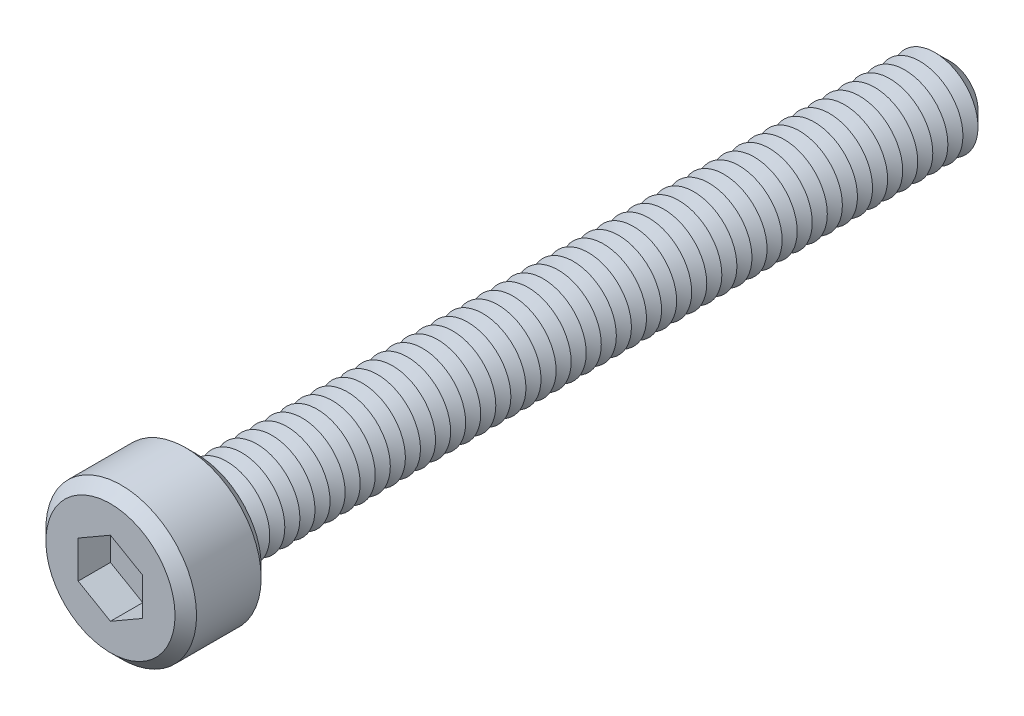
ISO-10303-21;
HEADER;
FILE_DESCRIPTION(('STEP AP214'),'2;1');
FILE_NAME('part.step','',(''),(''),'','','');
FILE_SCHEMA(('AUTOMOTIVE_DESIGN { 1 0 10303 214 1 1 1 1 }'));
ENDSEC;
DATA;
#1=APPLICATION_CONTEXT('core data for automotive mechanical design processes');
#2=APPLICATION_PROTOCOL_DEFINITION('international standard','automotive_design',2000,#1);
#3=PRODUCT_CONTEXT('',#1,'mechanical');
#4=PRODUCT('Part','Part','',(#3));
#5=PRODUCT_RELATED_PRODUCT_CATEGORY('part','',(#4));
#6=PRODUCT_DEFINITION_FORMATION('','',#4);
#7=PRODUCT_DEFINITION_CONTEXT('part definition',#1,'design');
#8=PRODUCT_DEFINITION('design','',#6,#7);
#9=PRODUCT_DEFINITION_SHAPE('','',#8);
#10=(LENGTH_UNIT() NAMED_UNIT(*) SI_UNIT(.MILLI.,.METRE.));
#11=(NAMED_UNIT(*) PLANE_ANGLE_UNIT() SI_UNIT($,.RADIAN.));
#12=(NAMED_UNIT(*) SI_UNIT($,.STERADIAN.) SOLID_ANGLE_UNIT());
#13=UNCERTAINTY_MEASURE_WITH_UNIT(LENGTH_MEASURE(1.E-05),#10,'distance_accuracy_value','');
#14=(GEOMETRIC_REPRESENTATION_CONTEXT(3) GLOBAL_UNCERTAINTY_ASSIGNED_CONTEXT((#13)) GLOBAL_UNIT_ASSIGNED_CONTEXT((#10,
#11,#12)) REPRESENTATION_CONTEXT('',''));
#15=CARTESIAN_POINT('',(0.,0.,0.));
#16=DIRECTION('',(0.,0.,1.));
#17=DIRECTION('',(1.,0.,0.));
#18=AXIS2_PLACEMENT_3D('',#15,#16,#17);
#19=CARTESIAN_POINT('',(0.,0.,4.));
#20=DIRECTION('',(0.,0.,-1.));
#21=DIRECTION('',(-1.,0.,0.));
#22=AXIS2_PLACEMENT_3D('',#19,#20,#21);
#23=CYLINDRICAL_SURFACE('',#22,3.5);
#24=CARTESIAN_POINT('',(0.,0.,0.500000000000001));
#25=DIRECTION('',(0.,0.,1.));
#26=DIRECTION('',(1.,0.,0.));
#27=AXIS2_PLACEMENT_3D('',#24,#25,#26);
#28=CIRCLE('',#27,3.5);
#29=CARTESIAN_POINT('',(3.5,0.,0.500000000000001));
#30=VERTEX_POINT('',#29);
#31=EDGE_CURVE('E568',#30,#30,#28,.T.);
#32=ORIENTED_EDGE('',*,*,#31,.T.);
#33=EDGE_LOOP('',(#32));
#34=FACE_BOUND('',#33,.T.);
#35=CARTESIAN_POINT('',(0.,0.,3.50000000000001));
#36=DIRECTION('',(0.,0.,1.));
#37=DIRECTION('',(1.,0.,0.));
#38=AXIS2_PLACEMENT_3D('',#35,#36,#37);
#39=CIRCLE('',#38,3.5);
#40=CARTESIAN_POINT('',(3.5,0.,3.50000000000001));
#41=VERTEX_POINT('',#40);
#42=EDGE_CURVE('E564',#41,#41,#39,.F.);
#43=ORIENTED_EDGE('',*,*,#42,.T.);
#44=EDGE_LOOP('',(#43));
#45=FACE_BOUND('',#44,.T.);
#46=ADVANCED_FACE('F39',(#34,#45),#23,.T.);
#47=CARTESIAN_POINT('',(0.,0.,4.));
#48=DIRECTION('',(0.,0.,1.));
#49=DIRECTION('',(1.,0.,0.));
#50=AXIS2_PLACEMENT_3D('',#47,#48,#49);
#51=PLANE('',#50);
#52=CARTESIAN_POINT('',(0.,0.,4.));
#53=DIRECTION('',(0.,0.,1.));
#54=DIRECTION('',(1.,0.,0.));
#55=AXIS2_PLACEMENT_3D('',#52,#53,#54);
#56=CIRCLE('',#55,3.00000000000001);
#57=CARTESIAN_POINT('',(3.00000000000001,0.,4.));
#58=VERTEX_POINT('',#57);
#59=EDGE_CURVE('E11',#58,#58,#56,.T.);
#60=ORIENTED_EDGE('',*,*,#59,.T.);
#61=EDGE_LOOP('',(#60));
#62=FACE_BOUND('',#61,.T.);
#63=DIRECTION('',(-0.866025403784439,0.5,0.));
#64=VECTOR('',#63,1.);
#65=CARTESIAN_POINT('',(1.5,0.866025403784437,4.));
#66=LINE('',#65,#64);
#67=CARTESIAN_POINT('',(1.5,0.866025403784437,4.));
#68=VERTEX_POINT('',#67);
#69=CARTESIAN_POINT('',(0.,1.73205080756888,4.));
#70=VERTEX_POINT('',#69);
#71=EDGE_CURVE('E55',#68,#70,#66,.T.);
#72=ORIENTED_EDGE('',*,*,#71,.F.);
#73=DIRECTION('',(0.,1.,0.));
#74=VECTOR('',#73,1.);
#75=CARTESIAN_POINT('',(1.5,-0.866025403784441,4.));
#76=LINE('',#75,#74);
#77=CARTESIAN_POINT('',(1.5,-0.866025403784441,4.));
#78=VERTEX_POINT('',#77);
#79=EDGE_CURVE('E150',#78,#68,#76,.T.);
#80=ORIENTED_EDGE('',*,*,#79,.F.);
#81=DIRECTION('',(0.866025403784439,0.5,0.));
#82=VECTOR('',#81,1.);
#83=CARTESIAN_POINT('',(0.,-1.73205080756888,4.));
#84=LINE('',#83,#82);
#85=CARTESIAN_POINT('',(0.,-1.73205080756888,4.));
#86=VERTEX_POINT('',#85);
#87=EDGE_CURVE('E147',#86,#78,#84,.T.);
#88=ORIENTED_EDGE('',*,*,#87,.F.);
#89=DIRECTION('',(0.866025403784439,-0.5,0.));
#90=VECTOR('',#89,1.);
#91=CARTESIAN_POINT('',(-1.5,-0.86602540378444,4.));
#92=LINE('',#91,#90);
#93=CARTESIAN_POINT('',(-1.5,-0.86602540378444,4.));
#94=VERTEX_POINT('',#93);
#95=EDGE_CURVE('E103',#94,#86,#92,.T.);
#96=ORIENTED_EDGE('',*,*,#95,.F.);
#97=DIRECTION('',(0.,-1.,0.));
#98=VECTOR('',#97,1.);
#99=CARTESIAN_POINT('',(-1.5,0.866025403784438,4.));
#100=LINE('',#99,#98);
#101=CARTESIAN_POINT('',(-1.5,0.866025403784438,4.));
#102=VERTEX_POINT('',#101);
#103=EDGE_CURVE('E142',#102,#94,#100,.T.);
#104=ORIENTED_EDGE('',*,*,#103,.F.);
#105=DIRECTION('',(-0.866025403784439,-0.5,0.));
#106=VECTOR('',#105,1.);
#107=CARTESIAN_POINT('',(0.,1.73205080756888,4.));
#108=LINE('',#107,#106);
#109=EDGE_CURVE('E137',#70,#102,#108,.T.);
#110=ORIENTED_EDGE('',*,*,#109,.F.);
#111=EDGE_LOOP('',(#72,#80,#88,#96,#104,#110));
#112=FACE_BOUND('',#111,.T.);
#113=ADVANCED_FACE('F587',(#62,#112),#51,.T.);
#114=CARTESIAN_POINT('',(0.,0.,0.));
#115=DIRECTION('',(0.,0.,1.));
#116=DIRECTION('',(1.,0.,0.));
#117=AXIS2_PLACEMENT_3D('',#114,#115,#116);
#118=PLANE('',#117);
#119=CARTESIAN_POINT('',(0.,0.,0.));
#120=DIRECTION('',(0.,0.,1.));
#121=DIRECTION('',(1.,0.,0.));
#122=AXIS2_PLACEMENT_3D('',#119,#120,#121);
#123=CIRCLE('',#122,3.);
#124=CARTESIAN_POINT('',(3.,0.,0.));
#125=VERTEX_POINT('',#124);
#126=EDGE_CURVE('E48',#125,#125,#123,.F.);
#127=ORIENTED_EDGE('',*,*,#126,.T.);
#128=EDGE_LOOP('',(#127));
#129=FACE_BOUND('',#128,.T.);
#130=CARTESIAN_POINT('',(0.,0.,0.));
#131=DIRECTION('',(0.,0.,1.));
#132=DIRECTION('',(1.,0.,0.));
#133=AXIS2_PLACEMENT_3D('',#130,#131,#132);
#134=CIRCLE('',#133,2.);
#135=CARTESIAN_POINT('',(2.,0.,0.));
#136=VERTEX_POINT('',#135);
#137=EDGE_CURVE('E556',#136,#136,#134,.T.);
#138=ORIENTED_EDGE('',*,*,#137,.T.);
#139=EDGE_LOOP('',(#138));
#140=FACE_BOUND('',#139,.T.);
#141=ADVANCED_FACE('F576',(#129,#140),#118,.F.);
#142=CARTESIAN_POINT('',(0.,0.,0.));
#143=DIRECTION('',(0.,0.,1.));
#144=DIRECTION('',(1.,0.,0.));
#145=AXIS2_PLACEMENT_3D('',#142,#143,#144);
#146=CONICAL_SURFACE('',#145,2.,1.0471975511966);
#147=CARTESIAN_POINT('',(0.,0.,-0.35));
#148=DIRECTION('',(0.,0.,1.));
#149=DIRECTION('',(1.,0.,0.));
#150=AXIS2_PLACEMENT_3D('',#147,#148,#149);
#151=CIRCLE('',#150,1.39378221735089);
#152=CARTESIAN_POINT('',(1.39378221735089,0.,-0.35));
#153=VERTEX_POINT('',#152);
#154=EDGE_CURVE('E552',#153,#153,#151,.T.);
#155=ORIENTED_EDGE('',*,*,#154,.T.);
#156=EDGE_LOOP('',(#155));
#157=FACE_BOUND('',#156,.T.);
#158=ORIENTED_EDGE('',*,*,#137,.F.);
#159=EDGE_LOOP('',(#158));
#160=FACE_BOUND('',#159,.T.);
#161=ADVANCED_FACE('F1028',(#157,#160),#146,.T.);
#162=CARTESIAN_POINT('',(0.,0.,-0.35));
#163=DIRECTION('',(0.,0.,-1.));
#164=DIRECTION('',(-1.,0.,0.));
#165=AXIS2_PLACEMENT_3D('',#162,#163,#164);
#166=CONICAL_SURFACE('',#165,1.39378221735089,1.0471975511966);
#167=CARTESIAN_POINT('',(0.,0.,-0.7));
#168=DIRECTION('',(0.,0.,1.));
#169=DIRECTION('',(1.,0.,0.));
#170=AXIS2_PLACEMENT_3D('',#167,#168,#169);
#171=CIRCLE('',#170,2.);
#172=CARTESIAN_POINT('',(2.,0.,-0.7));
#173=VERTEX_POINT('',#172);
#174=EDGE_CURVE('E548',#173,#173,#171,.T.);
#175=ORIENTED_EDGE('',*,*,#174,.T.);
#176=EDGE_LOOP('',(#175));
#177=FACE_BOUND('',#176,.T.);
#178=ORIENTED_EDGE('',*,*,#154,.F.);
#179=EDGE_LOOP('',(#178));
#180=FACE_BOUND('',#179,.T.);
#181=ADVANCED_FACE('F1024',(#177,#180),#166,.T.);
#182=CARTESIAN_POINT('',(0.,0.,-0.7));
#183=DIRECTION('',(0.,0.,1.));
#184=DIRECTION('',(1.,0.,0.));
#185=AXIS2_PLACEMENT_3D('',#182,#183,#184);
#186=CONICAL_SURFACE('',#185,2.,1.0471975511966);
#187=CARTESIAN_POINT('',(0.,0.,-1.05));
#188=DIRECTION('',(0.,0.,1.));
#189=DIRECTION('',(1.,0.,0.));
#190=AXIS2_PLACEMENT_3D('',#187,#188,#189);
#191=CIRCLE('',#190,1.39378221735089);
#192=CARTESIAN_POINT('',(1.39378221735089,0.,-1.05));
#193=VERTEX_POINT('',#192);
#194=EDGE_CURVE('E544',#193,#193,#191,.T.);
#195=ORIENTED_EDGE('',*,*,#194,.T.);
#196=EDGE_LOOP('',(#195));
#197=FACE_BOUND('',#196,.T.);
#198=ORIENTED_EDGE('',*,*,#174,.F.);
#199=EDGE_LOOP('',(#198));
#200=FACE_BOUND('',#199,.T.);
#201=ADVANCED_FACE('F1020',(#197,#200),#186,.T.);
#202=CARTESIAN_POINT('',(0.,0.,-1.05));
#203=DIRECTION('',(0.,0.,-1.));
#204=DIRECTION('',(-1.,0.,0.));
#205=AXIS2_PLACEMENT_3D('',#202,#203,#204);
#206=CONICAL_SURFACE('',#205,1.39378221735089,1.0471975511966);
#207=CARTESIAN_POINT('',(0.,0.,-1.4));
#208=DIRECTION('',(0.,0.,1.));
#209=DIRECTION('',(1.,0.,0.));
#210=AXIS2_PLACEMENT_3D('',#207,#208,#209);
#211=CIRCLE('',#210,2.);
#212=CARTESIAN_POINT('',(2.,0.,-1.4));
#213=VERTEX_POINT('',#212);
#214=EDGE_CURVE('E540',#213,#213,#211,.T.);
#215=ORIENTED_EDGE('',*,*,#214,.T.);
#216=EDGE_LOOP('',(#215));
#217=FACE_BOUND('',#216,.T.);
#218=ORIENTED_EDGE('',*,*,#194,.F.);
#219=EDGE_LOOP('',(#218));
#220=FACE_BOUND('',#219,.T.);
#221=ADVANCED_FACE('F1016',(#217,#220),#206,.T.);
#222=CARTESIAN_POINT('',(0.,0.,-1.4));
#223=DIRECTION('',(0.,0.,1.));
#224=DIRECTION('',(1.,0.,0.));
#225=AXIS2_PLACEMENT_3D('',#222,#223,#224);
#226=CONICAL_SURFACE('',#225,2.,1.0471975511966);
#227=CARTESIAN_POINT('',(0.,0.,-1.75));
#228=DIRECTION('',(0.,0.,1.));
#229=DIRECTION('',(1.,0.,0.));
#230=AXIS2_PLACEMENT_3D('',#227,#228,#229);
#231=CIRCLE('',#230,1.39378221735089);
#232=CARTESIAN_POINT('',(1.39378221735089,0.,-1.75));
#233=VERTEX_POINT('',#232);
#234=EDGE_CURVE('E536',#233,#233,#231,.T.);
#235=ORIENTED_EDGE('',*,*,#234,.T.);
#236=EDGE_LOOP('',(#235));
#237=FACE_BOUND('',#236,.T.);
#238=ORIENTED_EDGE('',*,*,#214,.F.);
#239=EDGE_LOOP('',(#238));
#240=FACE_BOUND('',#239,.T.);
#241=ADVANCED_FACE('F1012',(#237,#240),#226,.T.);
#242=CARTESIAN_POINT('',(0.,0.,-1.75));
#243=DIRECTION('',(0.,0.,-1.));
#244=DIRECTION('',(-1.,0.,0.));
#245=AXIS2_PLACEMENT_3D('',#242,#243,#244);
#246=CONICAL_SURFACE('',#245,1.39378221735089,1.0471975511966);
#247=CARTESIAN_POINT('',(0.,0.,-2.1));
#248=DIRECTION('',(0.,0.,1.));
#249=DIRECTION('',(1.,0.,0.));
#250=AXIS2_PLACEMENT_3D('',#247,#248,#249);
#251=CIRCLE('',#250,2.);
#252=CARTESIAN_POINT('',(2.,0.,-2.1));
#253=VERTEX_POINT('',#252);
#254=EDGE_CURVE('E532',#253,#253,#251,.T.);
#255=ORIENTED_EDGE('',*,*,#254,.T.);
#256=EDGE_LOOP('',(#255));
#257=FACE_BOUND('',#256,.T.);
#258=ORIENTED_EDGE('',*,*,#234,.F.);
#259=EDGE_LOOP('',(#258));
#260=FACE_BOUND('',#259,.T.);
#261=ADVANCED_FACE('F1008',(#257,#260),#246,.T.);
#262=CARTESIAN_POINT('',(0.,0.,-2.1));
#263=DIRECTION('',(0.,0.,1.));
#264=DIRECTION('',(1.,0.,0.));
#265=AXIS2_PLACEMENT_3D('',#262,#263,#264);
#266=CONICAL_SURFACE('',#265,2.,1.0471975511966);
#267=CARTESIAN_POINT('',(0.,0.,-2.45));
#268=DIRECTION('',(0.,0.,1.));
#269=DIRECTION('',(1.,0.,0.));
#270=AXIS2_PLACEMENT_3D('',#267,#268,#269);
#271=CIRCLE('',#270,1.39378221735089);
#272=CARTESIAN_POINT('',(1.39378221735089,0.,-2.45));
#273=VERTEX_POINT('',#272);
#274=EDGE_CURVE('E528',#273,#273,#271,.T.);
#275=ORIENTED_EDGE('',*,*,#274,.T.);
#276=EDGE_LOOP('',(#275));
#277=FACE_BOUND('',#276,.T.);
#278=ORIENTED_EDGE('',*,*,#254,.F.);
#279=EDGE_LOOP('',(#278));
#280=FACE_BOUND('',#279,.T.);
#281=ADVANCED_FACE('F1004',(#277,#280),#266,.T.);
#282=CARTESIAN_POINT('',(0.,0.,-2.45));
#283=DIRECTION('',(0.,0.,-1.));
#284=DIRECTION('',(-1.,0.,0.));
#285=AXIS2_PLACEMENT_3D('',#282,#283,#284);
#286=CONICAL_SURFACE('',#285,1.39378221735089,1.0471975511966);
#287=CARTESIAN_POINT('',(0.,0.,-2.8));
#288=DIRECTION('',(0.,0.,1.));
#289=DIRECTION('',(1.,0.,0.));
#290=AXIS2_PLACEMENT_3D('',#287,#288,#289);
#291=CIRCLE('',#290,2.);
#292=CARTESIAN_POINT('',(2.,0.,-2.8));
#293=VERTEX_POINT('',#292);
#294=EDGE_CURVE('E524',#293,#293,#291,.T.);
#295=ORIENTED_EDGE('',*,*,#294,.T.);
#296=EDGE_LOOP('',(#295));
#297=FACE_BOUND('',#296,.T.);
#298=ORIENTED_EDGE('',*,*,#274,.F.);
#299=EDGE_LOOP('',(#298));
#300=FACE_BOUND('',#299,.T.);
#301=ADVANCED_FACE('F1000',(#297,#300),#286,.T.);
#302=CARTESIAN_POINT('',(0.,0.,-2.8));
#303=DIRECTION('',(0.,0.,1.));
#304=DIRECTION('',(1.,0.,0.));
#305=AXIS2_PLACEMENT_3D('',#302,#303,#304);
#306=CONICAL_SURFACE('',#305,2.,1.0471975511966);
#307=CARTESIAN_POINT('',(0.,0.,-3.15));
#308=DIRECTION('',(0.,0.,1.));
#309=DIRECTION('',(1.,0.,0.));
#310=AXIS2_PLACEMENT_3D('',#307,#308,#309);
#311=CIRCLE('',#310,1.39378221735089);
#312=CARTESIAN_POINT('',(1.39378221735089,0.,-3.15));
#313=VERTEX_POINT('',#312);
#314=EDGE_CURVE('E520',#313,#313,#311,.T.);
#315=ORIENTED_EDGE('',*,*,#314,.T.);
#316=EDGE_LOOP('',(#315));
#317=FACE_BOUND('',#316,.T.);
#318=ORIENTED_EDGE('',*,*,#294,.F.);
#319=EDGE_LOOP('',(#318));
#320=FACE_BOUND('',#319,.T.);
#321=ADVANCED_FACE('F996',(#317,#320),#306,.T.);
#322=CARTESIAN_POINT('',(0.,0.,-3.15));
#323=DIRECTION('',(0.,0.,-1.));
#324=DIRECTION('',(-1.,0.,0.));
#325=AXIS2_PLACEMENT_3D('',#322,#323,#324);
#326=CONICAL_SURFACE('',#325,1.39378221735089,1.0471975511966);
#327=CARTESIAN_POINT('',(0.,0.,-3.5));
#328=DIRECTION('',(0.,0.,1.));
#329=DIRECTION('',(1.,0.,0.));
#330=AXIS2_PLACEMENT_3D('',#327,#328,#329);
#331=CIRCLE('',#330,2.);
#332=CARTESIAN_POINT('',(2.,0.,-3.5));
#333=VERTEX_POINT('',#332);
#334=EDGE_CURVE('E516',#333,#333,#331,.T.);
#335=ORIENTED_EDGE('',*,*,#334,.T.);
#336=EDGE_LOOP('',(#335));
#337=FACE_BOUND('',#336,.T.);
#338=ORIENTED_EDGE('',*,*,#314,.F.);
#339=EDGE_LOOP('',(#338));
#340=FACE_BOUND('',#339,.T.);
#341=ADVANCED_FACE('F992',(#337,#340),#326,.T.);
#342=CARTESIAN_POINT('',(0.,0.,-3.5));
#343=DIRECTION('',(0.,0.,1.));
#344=DIRECTION('',(1.,0.,0.));
#345=AXIS2_PLACEMENT_3D('',#342,#343,#344);
#346=CONICAL_SURFACE('',#345,2.,1.0471975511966);
#347=CARTESIAN_POINT('',(0.,0.,-3.85));
#348=DIRECTION('',(0.,0.,1.));
#349=DIRECTION('',(1.,0.,0.));
#350=AXIS2_PLACEMENT_3D('',#347,#348,#349);
#351=CIRCLE('',#350,1.39378221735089);
#352=CARTESIAN_POINT('',(1.39378221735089,0.,-3.85));
#353=VERTEX_POINT('',#352);
#354=EDGE_CURVE('E512',#353,#353,#351,.T.);
#355=ORIENTED_EDGE('',*,*,#354,.T.);
#356=EDGE_LOOP('',(#355));
#357=FACE_BOUND('',#356,.T.);
#358=ORIENTED_EDGE('',*,*,#334,.F.);
#359=EDGE_LOOP('',(#358));
#360=FACE_BOUND('',#359,.T.);
#361=ADVANCED_FACE('F988',(#357,#360),#346,.T.);
#362=CARTESIAN_POINT('',(0.,0.,-3.85));
#363=DIRECTION('',(0.,0.,-1.));
#364=DIRECTION('',(-1.,0.,0.));
#365=AXIS2_PLACEMENT_3D('',#362,#363,#364);
#366=CONICAL_SURFACE('',#365,1.39378221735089,1.0471975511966);
#367=CARTESIAN_POINT('',(0.,0.,-4.2));
#368=DIRECTION('',(0.,0.,1.));
#369=DIRECTION('',(1.,0.,0.));
#370=AXIS2_PLACEMENT_3D('',#367,#368,#369);
#371=CIRCLE('',#370,2.);
#372=CARTESIAN_POINT('',(2.,0.,-4.2));
#373=VERTEX_POINT('',#372);
#374=EDGE_CURVE('E508',#373,#373,#371,.T.);
#375=ORIENTED_EDGE('',*,*,#374,.T.);
#376=EDGE_LOOP('',(#375));
#377=FACE_BOUND('',#376,.T.);
#378=ORIENTED_EDGE('',*,*,#354,.F.);
#379=EDGE_LOOP('',(#378));
#380=FACE_BOUND('',#379,.T.);
#381=ADVANCED_FACE('F984',(#377,#380),#366,.T.);
#382=CARTESIAN_POINT('',(0.,0.,-4.2));
#383=DIRECTION('',(0.,0.,1.));
#384=DIRECTION('',(1.,0.,0.));
#385=AXIS2_PLACEMENT_3D('',#382,#383,#384);
#386=CONICAL_SURFACE('',#385,2.,1.0471975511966);
#387=CARTESIAN_POINT('',(0.,0.,-4.55));
#388=DIRECTION('',(0.,0.,1.));
#389=DIRECTION('',(1.,0.,0.));
#390=AXIS2_PLACEMENT_3D('',#387,#388,#389);
#391=CIRCLE('',#390,1.39378221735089);
#392=CARTESIAN_POINT('',(1.39378221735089,0.,-4.55));
#393=VERTEX_POINT('',#392);
#394=EDGE_CURVE('E504',#393,#393,#391,.T.);
#395=ORIENTED_EDGE('',*,*,#394,.T.);
#396=EDGE_LOOP('',(#395));
#397=FACE_BOUND('',#396,.T.);
#398=ORIENTED_EDGE('',*,*,#374,.F.);
#399=EDGE_LOOP('',(#398));
#400=FACE_BOUND('',#399,.T.);
#401=ADVANCED_FACE('F980',(#397,#400),#386,.T.);
#402=CARTESIAN_POINT('',(0.,0.,-4.55));
#403=DIRECTION('',(0.,0.,-1.));
#404=DIRECTION('',(-1.,0.,0.));
#405=AXIS2_PLACEMENT_3D('',#402,#403,#404);
#406=CONICAL_SURFACE('',#405,1.39378221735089,1.0471975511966);
#407=CARTESIAN_POINT('',(0.,0.,-4.9));
#408=DIRECTION('',(0.,0.,1.));
#409=DIRECTION('',(1.,0.,0.));
#410=AXIS2_PLACEMENT_3D('',#407,#408,#409);
#411=CIRCLE('',#410,2.);
#412=CARTESIAN_POINT('',(2.,0.,-4.9));
#413=VERTEX_POINT('',#412);
#414=EDGE_CURVE('E500',#413,#413,#411,.T.);
#415=ORIENTED_EDGE('',*,*,#414,.T.);
#416=EDGE_LOOP('',(#415));
#417=FACE_BOUND('',#416,.T.);
#418=ORIENTED_EDGE('',*,*,#394,.F.);
#419=EDGE_LOOP('',(#418));
#420=FACE_BOUND('',#419,.T.);
#421=ADVANCED_FACE('F976',(#417,#420),#406,.T.);
#422=CARTESIAN_POINT('',(0.,0.,-4.9));
#423=DIRECTION('',(0.,0.,1.));
#424=DIRECTION('',(1.,0.,0.));
#425=AXIS2_PLACEMENT_3D('',#422,#423,#424);
#426=CONICAL_SURFACE('',#425,2.,1.0471975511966);
#427=CARTESIAN_POINT('',(0.,0.,-5.25));
#428=DIRECTION('',(0.,0.,1.));
#429=DIRECTION('',(1.,0.,0.));
#430=AXIS2_PLACEMENT_3D('',#427,#428,#429);
#431=CIRCLE('',#430,1.39378221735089);
#432=CARTESIAN_POINT('',(1.39378221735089,0.,-5.25));
#433=VERTEX_POINT('',#432);
#434=EDGE_CURVE('E496',#433,#433,#431,.T.);
#435=ORIENTED_EDGE('',*,*,#434,.T.);
#436=EDGE_LOOP('',(#435));
#437=FACE_BOUND('',#436,.T.);
#438=ORIENTED_EDGE('',*,*,#414,.F.);
#439=EDGE_LOOP('',(#438));
#440=FACE_BOUND('',#439,.T.);
#441=ADVANCED_FACE('F972',(#437,#440),#426,.T.);
#442=CARTESIAN_POINT('',(0.,0.,-5.25));
#443=DIRECTION('',(0.,0.,-1.));
#444=DIRECTION('',(-1.,0.,0.));
#445=AXIS2_PLACEMENT_3D('',#442,#443,#444);
#446=CONICAL_SURFACE('',#445,1.39378221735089,1.0471975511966);
#447=CARTESIAN_POINT('',(0.,0.,-5.6));
#448=DIRECTION('',(0.,0.,1.));
#449=DIRECTION('',(1.,0.,0.));
#450=AXIS2_PLACEMENT_3D('',#447,#448,#449);
#451=CIRCLE('',#450,2.);
#452=CARTESIAN_POINT('',(2.,0.,-5.6));
#453=VERTEX_POINT('',#452);
#454=EDGE_CURVE('E492',#453,#453,#451,.T.);
#455=ORIENTED_EDGE('',*,*,#454,.T.);
#456=EDGE_LOOP('',(#455));
#457=FACE_BOUND('',#456,.T.);
#458=ORIENTED_EDGE('',*,*,#434,.F.);
#459=EDGE_LOOP('',(#458));
#460=FACE_BOUND('',#459,.T.);
#461=ADVANCED_FACE('F968',(#457,#460),#446,.T.);
#462=CARTESIAN_POINT('',(0.,0.,-5.6));
#463=DIRECTION('',(0.,0.,1.));
#464=DIRECTION('',(1.,0.,0.));
#465=AXIS2_PLACEMENT_3D('',#462,#463,#464);
#466=CONICAL_SURFACE('',#465,2.,1.0471975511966);
#467=CARTESIAN_POINT('',(0.,0.,-5.95));
#468=DIRECTION('',(0.,0.,1.));
#469=DIRECTION('',(1.,0.,0.));
#470=AXIS2_PLACEMENT_3D('',#467,#468,#469);
#471=CIRCLE('',#470,1.39378221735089);
#472=CARTESIAN_POINT('',(1.39378221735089,0.,-5.95));
#473=VERTEX_POINT('',#472);
#474=EDGE_CURVE('E488',#473,#473,#471,.T.);
#475=ORIENTED_EDGE('',*,*,#474,.T.);
#476=EDGE_LOOP('',(#475));
#477=FACE_BOUND('',#476,.T.);
#478=ORIENTED_EDGE('',*,*,#454,.F.);
#479=EDGE_LOOP('',(#478));
#480=FACE_BOUND('',#479,.T.);
#481=ADVANCED_FACE('F964',(#477,#480),#466,.T.);
#482=CARTESIAN_POINT('',(0.,0.,-5.95));
#483=DIRECTION('',(0.,0.,-1.));
#484=DIRECTION('',(-1.,0.,0.));
#485=AXIS2_PLACEMENT_3D('',#482,#483,#484);
#486=CONICAL_SURFACE('',#485,1.39378221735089,1.0471975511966);
#487=CARTESIAN_POINT('',(0.,0.,-6.3));
#488=DIRECTION('',(0.,0.,1.));
#489=DIRECTION('',(1.,0.,0.));
#490=AXIS2_PLACEMENT_3D('',#487,#488,#489);
#491=CIRCLE('',#490,2.);
#492=CARTESIAN_POINT('',(2.,0.,-6.3));
#493=VERTEX_POINT('',#492);
#494=EDGE_CURVE('E484',#493,#493,#491,.T.);
#495=ORIENTED_EDGE('',*,*,#494,.T.);
#496=EDGE_LOOP('',(#495));
#497=FACE_BOUND('',#496,.T.);
#498=ORIENTED_EDGE('',*,*,#474,.F.);
#499=EDGE_LOOP('',(#498));
#500=FACE_BOUND('',#499,.T.);
#501=ADVANCED_FACE('F960',(#497,#500),#486,.T.);
#502=CARTESIAN_POINT('',(0.,0.,-6.3));
#503=DIRECTION('',(0.,0.,1.));
#504=DIRECTION('',(1.,0.,0.));
#505=AXIS2_PLACEMENT_3D('',#502,#503,#504);
#506=CONICAL_SURFACE('',#505,2.,1.0471975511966);
#507=CARTESIAN_POINT('',(0.,0.,-6.65));
#508=DIRECTION('',(0.,0.,1.));
#509=DIRECTION('',(1.,0.,0.));
#510=AXIS2_PLACEMENT_3D('',#507,#508,#509);
#511=CIRCLE('',#510,1.39378221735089);
#512=CARTESIAN_POINT('',(1.39378221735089,0.,-6.65));
#513=VERTEX_POINT('',#512);
#514=EDGE_CURVE('E480',#513,#513,#511,.T.);
#515=ORIENTED_EDGE('',*,*,#514,.T.);
#516=EDGE_LOOP('',(#515));
#517=FACE_BOUND('',#516,.T.);
#518=ORIENTED_EDGE('',*,*,#494,.F.);
#519=EDGE_LOOP('',(#518));
#520=FACE_BOUND('',#519,.T.);
#521=ADVANCED_FACE('F956',(#517,#520),#506,.T.);
#522=CARTESIAN_POINT('',(0.,0.,-6.65));
#523=DIRECTION('',(0.,0.,-1.));
#524=DIRECTION('',(-1.,0.,0.));
#525=AXIS2_PLACEMENT_3D('',#522,#523,#524);
#526=CONICAL_SURFACE('',#525,1.39378221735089,1.0471975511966);
#527=CARTESIAN_POINT('',(0.,0.,-7.));
#528=DIRECTION('',(0.,0.,1.));
#529=DIRECTION('',(1.,0.,0.));
#530=AXIS2_PLACEMENT_3D('',#527,#528,#529);
#531=CIRCLE('',#530,2.);
#532=CARTESIAN_POINT('',(2.,0.,-7.));
#533=VERTEX_POINT('',#532);
#534=EDGE_CURVE('E476',#533,#533,#531,.T.);
#535=ORIENTED_EDGE('',*,*,#534,.T.);
#536=EDGE_LOOP('',(#535));
#537=FACE_BOUND('',#536,.T.);
#538=ORIENTED_EDGE('',*,*,#514,.F.);
#539=EDGE_LOOP('',(#538));
#540=FACE_BOUND('',#539,.T.);
#541=ADVANCED_FACE('F952',(#537,#540),#526,.T.);
#542=CARTESIAN_POINT('',(0.,0.,-7.));
#543=DIRECTION('',(0.,0.,1.));
#544=DIRECTION('',(1.,0.,0.));
#545=AXIS2_PLACEMENT_3D('',#542,#543,#544);
#546=CONICAL_SURFACE('',#545,2.,1.0471975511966);
#547=CARTESIAN_POINT('',(0.,0.,-7.35));
#548=DIRECTION('',(0.,0.,1.));
#549=DIRECTION('',(1.,0.,0.));
#550=AXIS2_PLACEMENT_3D('',#547,#548,#549);
#551=CIRCLE('',#550,1.39378221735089);
#552=CARTESIAN_POINT('',(1.39378221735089,0.,-7.35));
#553=VERTEX_POINT('',#552);
#554=EDGE_CURVE('E472',#553,#553,#551,.T.);
#555=ORIENTED_EDGE('',*,*,#554,.T.);
#556=EDGE_LOOP('',(#555));
#557=FACE_BOUND('',#556,.T.);
#558=ORIENTED_EDGE('',*,*,#534,.F.);
#559=EDGE_LOOP('',(#558));
#560=FACE_BOUND('',#559,.T.);
#561=ADVANCED_FACE('F948',(#557,#560),#546,.T.);
#562=CARTESIAN_POINT('',(0.,0.,-7.35));
#563=DIRECTION('',(0.,0.,-1.));
#564=DIRECTION('',(-1.,0.,0.));
#565=AXIS2_PLACEMENT_3D('',#562,#563,#564);
#566=CONICAL_SURFACE('',#565,1.39378221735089,1.0471975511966);
#567=CARTESIAN_POINT('',(0.,0.,-7.7));
#568=DIRECTION('',(0.,0.,1.));
#569=DIRECTION('',(1.,0.,0.));
#570=AXIS2_PLACEMENT_3D('',#567,#568,#569);
#571=CIRCLE('',#570,2.);
#572=CARTESIAN_POINT('',(2.,0.,-7.7));
#573=VERTEX_POINT('',#572);
#574=EDGE_CURVE('E468',#573,#573,#571,.T.);
#575=ORIENTED_EDGE('',*,*,#574,.T.);
#576=EDGE_LOOP('',(#575));
#577=FACE_BOUND('',#576,.T.);
#578=ORIENTED_EDGE('',*,*,#554,.F.);
#579=EDGE_LOOP('',(#578));
#580=FACE_BOUND('',#579,.T.);
#581=ADVANCED_FACE('F944',(#577,#580),#566,.T.);
#582=CARTESIAN_POINT('',(0.,0.,-7.7));
#583=DIRECTION('',(0.,0.,1.));
#584=DIRECTION('',(1.,0.,0.));
#585=AXIS2_PLACEMENT_3D('',#582,#583,#584);
#586=CONICAL_SURFACE('',#585,2.,1.0471975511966);
#587=CARTESIAN_POINT('',(0.,0.,-8.05));
#588=DIRECTION('',(0.,0.,1.));
#589=DIRECTION('',(1.,0.,0.));
#590=AXIS2_PLACEMENT_3D('',#587,#588,#589);
#591=CIRCLE('',#590,1.39378221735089);
#592=CARTESIAN_POINT('',(1.39378221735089,0.,-8.05));
#593=VERTEX_POINT('',#592);
#594=EDGE_CURVE('E464',#593,#593,#591,.T.);
#595=ORIENTED_EDGE('',*,*,#594,.T.);
#596=EDGE_LOOP('',(#595));
#597=FACE_BOUND('',#596,.T.);
#598=ORIENTED_EDGE('',*,*,#574,.F.);
#599=EDGE_LOOP('',(#598));
#600=FACE_BOUND('',#599,.T.);
#601=ADVANCED_FACE('F940',(#597,#600),#586,.T.);
#602=CARTESIAN_POINT('',(0.,0.,-8.05));
#603=DIRECTION('',(0.,0.,-1.));
#604=DIRECTION('',(-1.,0.,0.));
#605=AXIS2_PLACEMENT_3D('',#602,#603,#604);
#606=CONICAL_SURFACE('',#605,1.39378221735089,1.0471975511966);
#607=CARTESIAN_POINT('',(0.,0.,-8.4));
#608=DIRECTION('',(0.,0.,1.));
#609=DIRECTION('',(1.,0.,0.));
#610=AXIS2_PLACEMENT_3D('',#607,#608,#609);
#611=CIRCLE('',#610,2.);
#612=CARTESIAN_POINT('',(2.,0.,-8.4));
#613=VERTEX_POINT('',#612);
#614=EDGE_CURVE('E460',#613,#613,#611,.T.);
#615=ORIENTED_EDGE('',*,*,#614,.T.);
#616=EDGE_LOOP('',(#615));
#617=FACE_BOUND('',#616,.T.);
#618=ORIENTED_EDGE('',*,*,#594,.F.);
#619=EDGE_LOOP('',(#618));
#620=FACE_BOUND('',#619,.T.);
#621=ADVANCED_FACE('F936',(#617,#620),#606,.T.);
#622=CARTESIAN_POINT('',(0.,0.,-8.4));
#623=DIRECTION('',(0.,0.,1.));
#624=DIRECTION('',(1.,0.,0.));
#625=AXIS2_PLACEMENT_3D('',#622,#623,#624);
#626=CONICAL_SURFACE('',#625,2.,1.0471975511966);
#627=CARTESIAN_POINT('',(0.,0.,-8.75));
#628=DIRECTION('',(0.,0.,1.));
#629=DIRECTION('',(1.,0.,0.));
#630=AXIS2_PLACEMENT_3D('',#627,#628,#629);
#631=CIRCLE('',#630,1.39378221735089);
#632=CARTESIAN_POINT('',(1.39378221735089,0.,-8.75));
#633=VERTEX_POINT('',#632);
#634=EDGE_CURVE('E456',#633,#633,#631,.T.);
#635=ORIENTED_EDGE('',*,*,#634,.T.);
#636=EDGE_LOOP('',(#635));
#637=FACE_BOUND('',#636,.T.);
#638=ORIENTED_EDGE('',*,*,#614,.F.);
#639=EDGE_LOOP('',(#638));
#640=FACE_BOUND('',#639,.T.);
#641=ADVANCED_FACE('F932',(#637,#640),#626,.T.);
#642=CARTESIAN_POINT('',(0.,0.,-8.75));
#643=DIRECTION('',(0.,0.,-1.));
#644=DIRECTION('',(-1.,0.,0.));
#645=AXIS2_PLACEMENT_3D('',#642,#643,#644);
#646=CONICAL_SURFACE('',#645,1.39378221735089,1.0471975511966);
#647=CARTESIAN_POINT('',(0.,0.,-9.1));
#648=DIRECTION('',(0.,0.,1.));
#649=DIRECTION('',(1.,0.,0.));
#650=AXIS2_PLACEMENT_3D('',#647,#648,#649);
#651=CIRCLE('',#650,2.);
#652=CARTESIAN_POINT('',(2.,0.,-9.1));
#653=VERTEX_POINT('',#652);
#654=EDGE_CURVE('E452',#653,#653,#651,.T.);
#655=ORIENTED_EDGE('',*,*,#654,.T.);
#656=EDGE_LOOP('',(#655));
#657=FACE_BOUND('',#656,.T.);
#658=ORIENTED_EDGE('',*,*,#634,.F.);
#659=EDGE_LOOP('',(#658));
#660=FACE_BOUND('',#659,.T.);
#661=ADVANCED_FACE('F928',(#657,#660),#646,.T.);
#662=CARTESIAN_POINT('',(0.,0.,-9.1));
#663=DIRECTION('',(0.,0.,1.));
#664=DIRECTION('',(1.,0.,0.));
#665=AXIS2_PLACEMENT_3D('',#662,#663,#664);
#666=CONICAL_SURFACE('',#665,2.,1.0471975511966);
#667=CARTESIAN_POINT('',(0.,0.,-9.45));
#668=DIRECTION('',(0.,0.,1.));
#669=DIRECTION('',(1.,0.,0.));
#670=AXIS2_PLACEMENT_3D('',#667,#668,#669);
#671=CIRCLE('',#670,1.39378221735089);
#672=CARTESIAN_POINT('',(1.39378221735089,0.,-9.45));
#673=VERTEX_POINT('',#672);
#674=EDGE_CURVE('E448',#673,#673,#671,.T.);
#675=ORIENTED_EDGE('',*,*,#674,.T.);
#676=EDGE_LOOP('',(#675));
#677=FACE_BOUND('',#676,.T.);
#678=ORIENTED_EDGE('',*,*,#654,.F.);
#679=EDGE_LOOP('',(#678));
#680=FACE_BOUND('',#679,.T.);
#681=ADVANCED_FACE('F924',(#677,#680),#666,.T.);
#682=CARTESIAN_POINT('',(0.,0.,-9.45));
#683=DIRECTION('',(0.,0.,-1.));
#684=DIRECTION('',(-1.,0.,0.));
#685=AXIS2_PLACEMENT_3D('',#682,#683,#684);
#686=CONICAL_SURFACE('',#685,1.39378221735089,1.0471975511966);
#687=CARTESIAN_POINT('',(0.,0.,-9.8));
#688=DIRECTION('',(0.,0.,1.));
#689=DIRECTION('',(1.,0.,0.));
#690=AXIS2_PLACEMENT_3D('',#687,#688,#689);
#691=CIRCLE('',#690,2.);
#692=CARTESIAN_POINT('',(2.,0.,-9.8));
#693=VERTEX_POINT('',#692);
#694=EDGE_CURVE('E444',#693,#693,#691,.T.);
#695=ORIENTED_EDGE('',*,*,#694,.T.);
#696=EDGE_LOOP('',(#695));
#697=FACE_BOUND('',#696,.T.);
#698=ORIENTED_EDGE('',*,*,#674,.F.);
#699=EDGE_LOOP('',(#698));
#700=FACE_BOUND('',#699,.T.);
#701=ADVANCED_FACE('F920',(#697,#700),#686,.T.);
#702=CARTESIAN_POINT('',(0.,0.,-9.8));
#703=DIRECTION('',(0.,0.,1.));
#704=DIRECTION('',(1.,0.,0.));
#705=AXIS2_PLACEMENT_3D('',#702,#703,#704);
#706=CONICAL_SURFACE('',#705,2.,1.0471975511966);
#707=CARTESIAN_POINT('',(0.,0.,-10.15));
#708=DIRECTION('',(0.,0.,1.));
#709=DIRECTION('',(1.,0.,0.));
#710=AXIS2_PLACEMENT_3D('',#707,#708,#709);
#711=CIRCLE('',#710,1.39378221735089);
#712=CARTESIAN_POINT('',(1.39378221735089,0.,-10.15));
#713=VERTEX_POINT('',#712);
#714=EDGE_CURVE('E440',#713,#713,#711,.T.);
#715=ORIENTED_EDGE('',*,*,#714,.T.);
#716=EDGE_LOOP('',(#715));
#717=FACE_BOUND('',#716,.T.);
#718=ORIENTED_EDGE('',*,*,#694,.F.);
#719=EDGE_LOOP('',(#718));
#720=FACE_BOUND('',#719,.T.);
#721=ADVANCED_FACE('F916',(#717,#720),#706,.T.);
#722=CARTESIAN_POINT('',(0.,0.,-10.15));
#723=DIRECTION('',(0.,0.,-1.));
#724=DIRECTION('',(-1.,0.,0.));
#725=AXIS2_PLACEMENT_3D('',#722,#723,#724);
#726=CONICAL_SURFACE('',#725,1.39378221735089,1.0471975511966);
#727=CARTESIAN_POINT('',(0.,0.,-10.5));
#728=DIRECTION('',(0.,0.,1.));
#729=DIRECTION('',(1.,0.,0.));
#730=AXIS2_PLACEMENT_3D('',#727,#728,#729);
#731=CIRCLE('',#730,2.);
#732=CARTESIAN_POINT('',(2.,0.,-10.5));
#733=VERTEX_POINT('',#732);
#734=EDGE_CURVE('E436',#733,#733,#731,.T.);
#735=ORIENTED_EDGE('',*,*,#734,.T.);
#736=EDGE_LOOP('',(#735));
#737=FACE_BOUND('',#736,.T.);
#738=ORIENTED_EDGE('',*,*,#714,.F.);
#739=EDGE_LOOP('',(#738));
#740=FACE_BOUND('',#739,.T.);
#741=ADVANCED_FACE('F912',(#737,#740),#726,.T.);
#742=CARTESIAN_POINT('',(0.,0.,-10.5));
#743=DIRECTION('',(0.,0.,1.));
#744=DIRECTION('',(1.,0.,0.));
#745=AXIS2_PLACEMENT_3D('',#742,#743,#744);
#746=CONICAL_SURFACE('',#745,2.,1.0471975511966);
#747=CARTESIAN_POINT('',(0.,0.,-10.85));
#748=DIRECTION('',(0.,0.,1.));
#749=DIRECTION('',(1.,0.,0.));
#750=AXIS2_PLACEMENT_3D('',#747,#748,#749);
#751=CIRCLE('',#750,1.39378221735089);
#752=CARTESIAN_POINT('',(1.39378221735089,0.,-10.85));
#753=VERTEX_POINT('',#752);
#754=EDGE_CURVE('E432',#753,#753,#751,.T.);
#755=ORIENTED_EDGE('',*,*,#754,.T.);
#756=EDGE_LOOP('',(#755));
#757=FACE_BOUND('',#756,.T.);
#758=ORIENTED_EDGE('',*,*,#734,.F.);
#759=EDGE_LOOP('',(#758));
#760=FACE_BOUND('',#759,.T.);
#761=ADVANCED_FACE('F908',(#757,#760),#746,.T.);
#762=CARTESIAN_POINT('',(0.,0.,-10.85));
#763=DIRECTION('',(0.,0.,-1.));
#764=DIRECTION('',(-1.,0.,0.));
#765=AXIS2_PLACEMENT_3D('',#762,#763,#764);
#766=CONICAL_SURFACE('',#765,1.39378221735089,1.0471975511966);
#767=CARTESIAN_POINT('',(0.,0.,-11.2));
#768=DIRECTION('',(0.,0.,1.));
#769=DIRECTION('',(1.,0.,0.));
#770=AXIS2_PLACEMENT_3D('',#767,#768,#769);
#771=CIRCLE('',#770,2.);
#772=CARTESIAN_POINT('',(2.,0.,-11.2));
#773=VERTEX_POINT('',#772);
#774=EDGE_CURVE('E428',#773,#773,#771,.T.);
#775=ORIENTED_EDGE('',*,*,#774,.T.);
#776=EDGE_LOOP('',(#775));
#777=FACE_BOUND('',#776,.T.);
#778=ORIENTED_EDGE('',*,*,#754,.F.);
#779=EDGE_LOOP('',(#778));
#780=FACE_BOUND('',#779,.T.);
#781=ADVANCED_FACE('F904',(#777,#780),#766,.T.);
#782=CARTESIAN_POINT('',(0.,0.,-11.2));
#783=DIRECTION('',(0.,0.,1.));
#784=DIRECTION('',(1.,0.,0.));
#785=AXIS2_PLACEMENT_3D('',#782,#783,#784);
#786=CONICAL_SURFACE('',#785,2.,1.0471975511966);
#787=CARTESIAN_POINT('',(0.,0.,-11.55));
#788=DIRECTION('',(0.,0.,1.));
#789=DIRECTION('',(1.,0.,0.));
#790=AXIS2_PLACEMENT_3D('',#787,#788,#789);
#791=CIRCLE('',#790,1.39378221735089);
#792=CARTESIAN_POINT('',(1.39378221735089,0.,-11.55));
#793=VERTEX_POINT('',#792);
#794=EDGE_CURVE('E424',#793,#793,#791,.T.);
#795=ORIENTED_EDGE('',*,*,#794,.T.);
#796=EDGE_LOOP('',(#795));
#797=FACE_BOUND('',#796,.T.);
#798=ORIENTED_EDGE('',*,*,#774,.F.);
#799=EDGE_LOOP('',(#798));
#800=FACE_BOUND('',#799,.T.);
#801=ADVANCED_FACE('F900',(#797,#800),#786,.T.);
#802=CARTESIAN_POINT('',(0.,0.,-11.55));
#803=DIRECTION('',(0.,0.,-1.));
#804=DIRECTION('',(-1.,0.,0.));
#805=AXIS2_PLACEMENT_3D('',#802,#803,#804);
#806=CONICAL_SURFACE('',#805,1.39378221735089,1.0471975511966);
#807=CARTESIAN_POINT('',(0.,0.,-11.9));
#808=DIRECTION('',(0.,0.,1.));
#809=DIRECTION('',(1.,0.,0.));
#810=AXIS2_PLACEMENT_3D('',#807,#808,#809);
#811=CIRCLE('',#810,2.);
#812=CARTESIAN_POINT('',(2.,0.,-11.9));
#813=VERTEX_POINT('',#812);
#814=EDGE_CURVE('E420',#813,#813,#811,.T.);
#815=ORIENTED_EDGE('',*,*,#814,.T.);
#816=EDGE_LOOP('',(#815));
#817=FACE_BOUND('',#816,.T.);
#818=ORIENTED_EDGE('',*,*,#794,.F.);
#819=EDGE_LOOP('',(#818));
#820=FACE_BOUND('',#819,.T.);
#821=ADVANCED_FACE('F896',(#817,#820),#806,.T.);
#822=CARTESIAN_POINT('',(0.,0.,-11.9));
#823=DIRECTION('',(0.,0.,1.));
#824=DIRECTION('',(1.,0.,0.));
#825=AXIS2_PLACEMENT_3D('',#822,#823,#824);
#826=CONICAL_SURFACE('',#825,2.,1.0471975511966);
#827=CARTESIAN_POINT('',(0.,0.,-12.25));
#828=DIRECTION('',(0.,0.,1.));
#829=DIRECTION('',(1.,0.,0.));
#830=AXIS2_PLACEMENT_3D('',#827,#828,#829);
#831=CIRCLE('',#830,1.39378221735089);
#832=CARTESIAN_POINT('',(1.39378221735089,0.,-12.25));
#833=VERTEX_POINT('',#832);
#834=EDGE_CURVE('E416',#833,#833,#831,.T.);
#835=ORIENTED_EDGE('',*,*,#834,.T.);
#836=EDGE_LOOP('',(#835));
#837=FACE_BOUND('',#836,.T.);
#838=ORIENTED_EDGE('',*,*,#814,.F.);
#839=EDGE_LOOP('',(#838));
#840=FACE_BOUND('',#839,.T.);
#841=ADVANCED_FACE('F892',(#837,#840),#826,.T.);
#842=CARTESIAN_POINT('',(0.,0.,-12.25));
#843=DIRECTION('',(0.,0.,-1.));
#844=DIRECTION('',(-1.,0.,0.));
#845=AXIS2_PLACEMENT_3D('',#842,#843,#844);
#846=CONICAL_SURFACE('',#845,1.39378221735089,1.0471975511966);
#847=CARTESIAN_POINT('',(0.,0.,-12.6));
#848=DIRECTION('',(0.,0.,1.));
#849=DIRECTION('',(1.,0.,0.));
#850=AXIS2_PLACEMENT_3D('',#847,#848,#849);
#851=CIRCLE('',#850,2.);
#852=CARTESIAN_POINT('',(2.,0.,-12.6));
#853=VERTEX_POINT('',#852);
#854=EDGE_CURVE('E412',#853,#853,#851,.T.);
#855=ORIENTED_EDGE('',*,*,#854,.T.);
#856=EDGE_LOOP('',(#855));
#857=FACE_BOUND('',#856,.T.);
#858=ORIENTED_EDGE('',*,*,#834,.F.);
#859=EDGE_LOOP('',(#858));
#860=FACE_BOUND('',#859,.T.);
#861=ADVANCED_FACE('F888',(#857,#860),#846,.T.);
#862=CARTESIAN_POINT('',(0.,0.,-12.6));
#863=DIRECTION('',(0.,0.,1.));
#864=DIRECTION('',(1.,0.,0.));
#865=AXIS2_PLACEMENT_3D('',#862,#863,#864);
#866=CONICAL_SURFACE('',#865,2.,1.0471975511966);
#867=CARTESIAN_POINT('',(0.,0.,-12.95));
#868=DIRECTION('',(0.,0.,1.));
#869=DIRECTION('',(1.,0.,0.));
#870=AXIS2_PLACEMENT_3D('',#867,#868,#869);
#871=CIRCLE('',#870,1.39378221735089);
#872=CARTESIAN_POINT('',(1.39378221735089,0.,-12.95));
#873=VERTEX_POINT('',#872);
#874=EDGE_CURVE('E408',#873,#873,#871,.T.);
#875=ORIENTED_EDGE('',*,*,#874,.T.);
#876=EDGE_LOOP('',(#875));
#877=FACE_BOUND('',#876,.T.);
#878=ORIENTED_EDGE('',*,*,#854,.F.);
#879=EDGE_LOOP('',(#878));
#880=FACE_BOUND('',#879,.T.);
#881=ADVANCED_FACE('F884',(#877,#880),#866,.T.);
#882=CARTESIAN_POINT('',(0.,0.,-12.95));
#883=DIRECTION('',(0.,0.,-1.));
#884=DIRECTION('',(-1.,0.,0.));
#885=AXIS2_PLACEMENT_3D('',#882,#883,#884);
#886=CONICAL_SURFACE('',#885,1.39378221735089,1.0471975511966);
#887=CARTESIAN_POINT('',(0.,0.,-13.3));
#888=DIRECTION('',(0.,0.,1.));
#889=DIRECTION('',(1.,0.,0.));
#890=AXIS2_PLACEMENT_3D('',#887,#888,#889);
#891=CIRCLE('',#890,2.);
#892=CARTESIAN_POINT('',(2.,0.,-13.3));
#893=VERTEX_POINT('',#892);
#894=EDGE_CURVE('E404',#893,#893,#891,.T.);
#895=ORIENTED_EDGE('',*,*,#894,.T.);
#896=EDGE_LOOP('',(#895));
#897=FACE_BOUND('',#896,.T.);
#898=ORIENTED_EDGE('',*,*,#874,.F.);
#899=EDGE_LOOP('',(#898));
#900=FACE_BOUND('',#899,.T.);
#901=ADVANCED_FACE('F880',(#897,#900),#886,.T.);
#902=CARTESIAN_POINT('',(0.,0.,-13.3));
#903=DIRECTION('',(0.,0.,1.));
#904=DIRECTION('',(1.,0.,0.));
#905=AXIS2_PLACEMENT_3D('',#902,#903,#904);
#906=CONICAL_SURFACE('',#905,2.,1.0471975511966);
#907=CARTESIAN_POINT('',(0.,0.,-13.65));
#908=DIRECTION('',(0.,0.,1.));
#909=DIRECTION('',(1.,0.,0.));
#910=AXIS2_PLACEMENT_3D('',#907,#908,#909);
#911=CIRCLE('',#910,1.39378221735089);
#912=CARTESIAN_POINT('',(1.39378221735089,0.,-13.65));
#913=VERTEX_POINT('',#912);
#914=EDGE_CURVE('E400',#913,#913,#911,.T.);
#915=ORIENTED_EDGE('',*,*,#914,.T.);
#916=EDGE_LOOP('',(#915));
#917=FACE_BOUND('',#916,.T.);
#918=ORIENTED_EDGE('',*,*,#894,.F.);
#919=EDGE_LOOP('',(#918));
#920=FACE_BOUND('',#919,.T.);
#921=ADVANCED_FACE('F876',(#917,#920),#906,.T.);
#922=CARTESIAN_POINT('',(0.,0.,-13.65));
#923=DIRECTION('',(0.,0.,-1.));
#924=DIRECTION('',(-1.,0.,0.));
#925=AXIS2_PLACEMENT_3D('',#922,#923,#924);
#926=CONICAL_SURFACE('',#925,1.39378221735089,1.0471975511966);
#927=CARTESIAN_POINT('',(0.,0.,-14.));
#928=DIRECTION('',(0.,0.,1.));
#929=DIRECTION('',(1.,0.,0.));
#930=AXIS2_PLACEMENT_3D('',#927,#928,#929);
#931=CIRCLE('',#930,2.);
#932=CARTESIAN_POINT('',(2.,0.,-14.));
#933=VERTEX_POINT('',#932);
#934=EDGE_CURVE('E396',#933,#933,#931,.T.);
#935=ORIENTED_EDGE('',*,*,#934,.T.);
#936=EDGE_LOOP('',(#935));
#937=FACE_BOUND('',#936,.T.);
#938=ORIENTED_EDGE('',*,*,#914,.F.);
#939=EDGE_LOOP('',(#938));
#940=FACE_BOUND('',#939,.T.);
#941=ADVANCED_FACE('F872',(#937,#940),#926,.T.);
#942=CARTESIAN_POINT('',(0.,0.,-14.));
#943=DIRECTION('',(0.,0.,1.));
#944=DIRECTION('',(1.,0.,0.));
#945=AXIS2_PLACEMENT_3D('',#942,#943,#944);
#946=CONICAL_SURFACE('',#945,2.,1.0471975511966);
#947=CARTESIAN_POINT('',(0.,0.,-14.35));
#948=DIRECTION('',(0.,0.,1.));
#949=DIRECTION('',(1.,0.,0.));
#950=AXIS2_PLACEMENT_3D('',#947,#948,#949);
#951=CIRCLE('',#950,1.39378221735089);
#952=CARTESIAN_POINT('',(1.39378221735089,0.,-14.35));
#953=VERTEX_POINT('',#952);
#954=EDGE_CURVE('E392',#953,#953,#951,.T.);
#955=ORIENTED_EDGE('',*,*,#954,.T.);
#956=EDGE_LOOP('',(#955));
#957=FACE_BOUND('',#956,.T.);
#958=ORIENTED_EDGE('',*,*,#934,.F.);
#959=EDGE_LOOP('',(#958));
#960=FACE_BOUND('',#959,.T.);
#961=ADVANCED_FACE('F868',(#957,#960),#946,.T.);
#962=CARTESIAN_POINT('',(0.,0.,-14.35));
#963=DIRECTION('',(0.,0.,-1.));
#964=DIRECTION('',(-1.,0.,0.));
#965=AXIS2_PLACEMENT_3D('',#962,#963,#964);
#966=CONICAL_SURFACE('',#965,1.39378221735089,1.0471975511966);
#967=CARTESIAN_POINT('',(0.,0.,-14.7));
#968=DIRECTION('',(0.,0.,1.));
#969=DIRECTION('',(1.,0.,0.));
#970=AXIS2_PLACEMENT_3D('',#967,#968,#969);
#971=CIRCLE('',#970,2.);
#972=CARTESIAN_POINT('',(2.,0.,-14.7));
#973=VERTEX_POINT('',#972);
#974=EDGE_CURVE('E388',#973,#973,#971,.T.);
#975=ORIENTED_EDGE('',*,*,#974,.T.);
#976=EDGE_LOOP('',(#975));
#977=FACE_BOUND('',#976,.T.);
#978=ORIENTED_EDGE('',*,*,#954,.F.);
#979=EDGE_LOOP('',(#978));
#980=FACE_BOUND('',#979,.T.);
#981=ADVANCED_FACE('F864',(#977,#980),#966,.T.);
#982=CARTESIAN_POINT('',(0.,0.,-14.7));
#983=DIRECTION('',(0.,0.,1.));
#984=DIRECTION('',(1.,0.,0.));
#985=AXIS2_PLACEMENT_3D('',#982,#983,#984);
#986=CONICAL_SURFACE('',#985,2.,1.0471975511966);
#987=CARTESIAN_POINT('',(0.,0.,-15.05));
#988=DIRECTION('',(0.,0.,1.));
#989=DIRECTION('',(1.,0.,0.));
#990=AXIS2_PLACEMENT_3D('',#987,#988,#989);
#991=CIRCLE('',#990,1.39378221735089);
#992=CARTESIAN_POINT('',(1.39378221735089,0.,-15.05));
#993=VERTEX_POINT('',#992);
#994=EDGE_CURVE('E384',#993,#993,#991,.T.);
#995=ORIENTED_EDGE('',*,*,#994,.T.);
#996=EDGE_LOOP('',(#995));
#997=FACE_BOUND('',#996,.T.);
#998=ORIENTED_EDGE('',*,*,#974,.F.);
#999=EDGE_LOOP('',(#998));
#1000=FACE_BOUND('',#999,.T.);
#1001=ADVANCED_FACE('F860',(#997,#1000),#986,.T.);
#1002=CARTESIAN_POINT('',(0.,0.,-15.05));
#1003=DIRECTION('',(0.,0.,-1.));
#1004=DIRECTION('',(-1.,0.,0.));
#1005=AXIS2_PLACEMENT_3D('',#1002,#1003,#1004);
#1006=CONICAL_SURFACE('',#1005,1.39378221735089,1.0471975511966);
#1007=CARTESIAN_POINT('',(0.,0.,-15.4));
#1008=DIRECTION('',(0.,0.,1.));
#1009=DIRECTION('',(1.,0.,0.));
#1010=AXIS2_PLACEMENT_3D('',#1007,#1008,#1009);
#1011=CIRCLE('',#1010,2.);
#1012=CARTESIAN_POINT('',(2.,0.,-15.4));
#1013=VERTEX_POINT('',#1012);
#1014=EDGE_CURVE('E380',#1013,#1013,#1011,.T.);
#1015=ORIENTED_EDGE('',*,*,#1014,.T.);
#1016=EDGE_LOOP('',(#1015));
#1017=FACE_BOUND('',#1016,.T.);
#1018=ORIENTED_EDGE('',*,*,#994,.F.);
#1019=EDGE_LOOP('',(#1018));
#1020=FACE_BOUND('',#1019,.T.);
#1021=ADVANCED_FACE('F856',(#1017,#1020),#1006,.T.);
#1022=CARTESIAN_POINT('',(0.,0.,-15.4));
#1023=DIRECTION('',(0.,0.,1.));
#1024=DIRECTION('',(1.,0.,0.));
#1025=AXIS2_PLACEMENT_3D('',#1022,#1023,#1024);
#1026=CONICAL_SURFACE('',#1025,2.,1.0471975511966);
#1027=CARTESIAN_POINT('',(0.,0.,-15.75));
#1028=DIRECTION('',(0.,0.,1.));
#1029=DIRECTION('',(1.,0.,0.));
#1030=AXIS2_PLACEMENT_3D('',#1027,#1028,#1029);
#1031=CIRCLE('',#1030,1.39378221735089);
#1032=CARTESIAN_POINT('',(1.39378221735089,0.,-15.75));
#1033=VERTEX_POINT('',#1032);
#1034=EDGE_CURVE('E376',#1033,#1033,#1031,.T.);
#1035=ORIENTED_EDGE('',*,*,#1034,.T.);
#1036=EDGE_LOOP('',(#1035));
#1037=FACE_BOUND('',#1036,.T.);
#1038=ORIENTED_EDGE('',*,*,#1014,.F.);
#1039=EDGE_LOOP('',(#1038));
#1040=FACE_BOUND('',#1039,.T.);
#1041=ADVANCED_FACE('F852',(#1037,#1040),#1026,.T.);
#1042=CARTESIAN_POINT('',(0.,0.,-15.75));
#1043=DIRECTION('',(0.,0.,-1.));
#1044=DIRECTION('',(-1.,0.,0.));
#1045=AXIS2_PLACEMENT_3D('',#1042,#1043,#1044);
#1046=CONICAL_SURFACE('',#1045,1.39378221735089,1.0471975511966);
#1047=CARTESIAN_POINT('',(0.,0.,-16.1));
#1048=DIRECTION('',(0.,0.,1.));
#1049=DIRECTION('',(1.,0.,0.));
#1050=AXIS2_PLACEMENT_3D('',#1047,#1048,#1049);
#1051=CIRCLE('',#1050,2.);
#1052=CARTESIAN_POINT('',(2.,0.,-16.1));
#1053=VERTEX_POINT('',#1052);
#1054=EDGE_CURVE('E372',#1053,#1053,#1051,.T.);
#1055=ORIENTED_EDGE('',*,*,#1054,.T.);
#1056=EDGE_LOOP('',(#1055));
#1057=FACE_BOUND('',#1056,.T.);
#1058=ORIENTED_EDGE('',*,*,#1034,.F.);
#1059=EDGE_LOOP('',(#1058));
#1060=FACE_BOUND('',#1059,.T.);
#1061=ADVANCED_FACE('F848',(#1057,#1060),#1046,.T.);
#1062=CARTESIAN_POINT('',(0.,0.,-16.1));
#1063=DIRECTION('',(0.,0.,1.));
#1064=DIRECTION('',(1.,0.,0.));
#1065=AXIS2_PLACEMENT_3D('',#1062,#1063,#1064);
#1066=CONICAL_SURFACE('',#1065,2.,1.0471975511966);
#1067=CARTESIAN_POINT('',(0.,0.,-16.45));
#1068=DIRECTION('',(0.,0.,1.));
#1069=DIRECTION('',(1.,0.,0.));
#1070=AXIS2_PLACEMENT_3D('',#1067,#1068,#1069);
#1071=CIRCLE('',#1070,1.39378221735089);
#1072=CARTESIAN_POINT('',(1.39378221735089,0.,-16.45));
#1073=VERTEX_POINT('',#1072);
#1074=EDGE_CURVE('E368',#1073,#1073,#1071,.T.);
#1075=ORIENTED_EDGE('',*,*,#1074,.T.);
#1076=EDGE_LOOP('',(#1075));
#1077=FACE_BOUND('',#1076,.T.);
#1078=ORIENTED_EDGE('',*,*,#1054,.F.);
#1079=EDGE_LOOP('',(#1078));
#1080=FACE_BOUND('',#1079,.T.);
#1081=ADVANCED_FACE('F844',(#1077,#1080),#1066,.T.);
#1082=CARTESIAN_POINT('',(0.,0.,-16.45));
#1083=DIRECTION('',(0.,0.,-1.));
#1084=DIRECTION('',(-1.,0.,0.));
#1085=AXIS2_PLACEMENT_3D('',#1082,#1083,#1084);
#1086=CONICAL_SURFACE('',#1085,1.39378221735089,1.0471975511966);
#1087=CARTESIAN_POINT('',(0.,0.,-16.8));
#1088=DIRECTION('',(0.,0.,1.));
#1089=DIRECTION('',(1.,0.,0.));
#1090=AXIS2_PLACEMENT_3D('',#1087,#1088,#1089);
#1091=CIRCLE('',#1090,2.);
#1092=CARTESIAN_POINT('',(2.,0.,-16.8));
#1093=VERTEX_POINT('',#1092);
#1094=EDGE_CURVE('E364',#1093,#1093,#1091,.T.);
#1095=ORIENTED_EDGE('',*,*,#1094,.T.);
#1096=EDGE_LOOP('',(#1095));
#1097=FACE_BOUND('',#1096,.T.);
#1098=ORIENTED_EDGE('',*,*,#1074,.F.);
#1099=EDGE_LOOP('',(#1098));
#1100=FACE_BOUND('',#1099,.T.);
#1101=ADVANCED_FACE('F840',(#1097,#1100),#1086,.T.);
#1102=CARTESIAN_POINT('',(0.,0.,-16.8));
#1103=DIRECTION('',(0.,0.,1.));
#1104=DIRECTION('',(1.,0.,0.));
#1105=AXIS2_PLACEMENT_3D('',#1102,#1103,#1104);
#1106=CONICAL_SURFACE('',#1105,2.,1.0471975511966);
#1107=CARTESIAN_POINT('',(0.,0.,-17.15));
#1108=DIRECTION('',(0.,0.,1.));
#1109=DIRECTION('',(1.,0.,0.));
#1110=AXIS2_PLACEMENT_3D('',#1107,#1108,#1109);
#1111=CIRCLE('',#1110,1.39378221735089);
#1112=CARTESIAN_POINT('',(1.39378221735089,0.,-17.15));
#1113=VERTEX_POINT('',#1112);
#1114=EDGE_CURVE('E360',#1113,#1113,#1111,.T.);
#1115=ORIENTED_EDGE('',*,*,#1114,.T.);
#1116=EDGE_LOOP('',(#1115));
#1117=FACE_BOUND('',#1116,.T.);
#1118=ORIENTED_EDGE('',*,*,#1094,.F.);
#1119=EDGE_LOOP('',(#1118));
#1120=FACE_BOUND('',#1119,.T.);
#1121=ADVANCED_FACE('F836',(#1117,#1120),#1106,.T.);
#1122=CARTESIAN_POINT('',(0.,0.,-17.15));
#1123=DIRECTION('',(0.,0.,-1.));
#1124=DIRECTION('',(-1.,0.,0.));
#1125=AXIS2_PLACEMENT_3D('',#1122,#1123,#1124);
#1126=CONICAL_SURFACE('',#1125,1.39378221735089,1.0471975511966);
#1127=CARTESIAN_POINT('',(0.,0.,-17.5));
#1128=DIRECTION('',(0.,0.,1.));
#1129=DIRECTION('',(1.,0.,0.));
#1130=AXIS2_PLACEMENT_3D('',#1127,#1128,#1129);
#1131=CIRCLE('',#1130,2.);
#1132=CARTESIAN_POINT('',(2.,0.,-17.5));
#1133=VERTEX_POINT('',#1132);
#1134=EDGE_CURVE('E356',#1133,#1133,#1131,.T.);
#1135=ORIENTED_EDGE('',*,*,#1134,.T.);
#1136=EDGE_LOOP('',(#1135));
#1137=FACE_BOUND('',#1136,.T.);
#1138=ORIENTED_EDGE('',*,*,#1114,.F.);
#1139=EDGE_LOOP('',(#1138));
#1140=FACE_BOUND('',#1139,.T.);
#1141=ADVANCED_FACE('F832',(#1137,#1140),#1126,.T.);
#1142=CARTESIAN_POINT('',(0.,0.,-17.5));
#1143=DIRECTION('',(0.,0.,1.));
#1144=DIRECTION('',(1.,0.,0.));
#1145=AXIS2_PLACEMENT_3D('',#1142,#1143,#1144);
#1146=CONICAL_SURFACE('',#1145,2.,1.0471975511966);
#1147=CARTESIAN_POINT('',(0.,0.,-17.85));
#1148=DIRECTION('',(0.,0.,1.));
#1149=DIRECTION('',(1.,0.,0.));
#1150=AXIS2_PLACEMENT_3D('',#1147,#1148,#1149);
#1151=CIRCLE('',#1150,1.39378221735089);
#1152=CARTESIAN_POINT('',(1.39378221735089,0.,-17.85));
#1153=VERTEX_POINT('',#1152);
#1154=EDGE_CURVE('E352',#1153,#1153,#1151,.T.);
#1155=ORIENTED_EDGE('',*,*,#1154,.T.);
#1156=EDGE_LOOP('',(#1155));
#1157=FACE_BOUND('',#1156,.T.);
#1158=ORIENTED_EDGE('',*,*,#1134,.F.);
#1159=EDGE_LOOP('',(#1158));
#1160=FACE_BOUND('',#1159,.T.);
#1161=ADVANCED_FACE('F828',(#1157,#1160),#1146,.T.);
#1162=CARTESIAN_POINT('',(0.,0.,-17.85));
#1163=DIRECTION('',(0.,0.,-1.));
#1164=DIRECTION('',(-1.,0.,0.));
#1165=AXIS2_PLACEMENT_3D('',#1162,#1163,#1164);
#1166=CONICAL_SURFACE('',#1165,1.39378221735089,1.0471975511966);
#1167=CARTESIAN_POINT('',(0.,0.,-18.2));
#1168=DIRECTION('',(0.,0.,1.));
#1169=DIRECTION('',(1.,0.,0.));
#1170=AXIS2_PLACEMENT_3D('',#1167,#1168,#1169);
#1171=CIRCLE('',#1170,2.);
#1172=CARTESIAN_POINT('',(2.,0.,-18.2));
#1173=VERTEX_POINT('',#1172);
#1174=EDGE_CURVE('E348',#1173,#1173,#1171,.T.);
#1175=ORIENTED_EDGE('',*,*,#1174,.T.);
#1176=EDGE_LOOP('',(#1175));
#1177=FACE_BOUND('',#1176,.T.);
#1178=ORIENTED_EDGE('',*,*,#1154,.F.);
#1179=EDGE_LOOP('',(#1178));
#1180=FACE_BOUND('',#1179,.T.);
#1181=ADVANCED_FACE('F824',(#1177,#1180),#1166,.T.);
#1182=CARTESIAN_POINT('',(0.,0.,-18.2));
#1183=DIRECTION('',(0.,0.,1.));
#1184=DIRECTION('',(1.,0.,0.));
#1185=AXIS2_PLACEMENT_3D('',#1182,#1183,#1184);
#1186=CONICAL_SURFACE('',#1185,2.,1.0471975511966);
#1187=CARTESIAN_POINT('',(0.,0.,-18.55));
#1188=DIRECTION('',(0.,0.,1.));
#1189=DIRECTION('',(1.,0.,0.));
#1190=AXIS2_PLACEMENT_3D('',#1187,#1188,#1189);
#1191=CIRCLE('',#1190,1.39378221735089);
#1192=CARTESIAN_POINT('',(1.39378221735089,0.,-18.55));
#1193=VERTEX_POINT('',#1192);
#1194=EDGE_CURVE('E344',#1193,#1193,#1191,.T.);
#1195=ORIENTED_EDGE('',*,*,#1194,.T.);
#1196=EDGE_LOOP('',(#1195));
#1197=FACE_BOUND('',#1196,.T.);
#1198=ORIENTED_EDGE('',*,*,#1174,.F.);
#1199=EDGE_LOOP('',(#1198));
#1200=FACE_BOUND('',#1199,.T.);
#1201=ADVANCED_FACE('F820',(#1197,#1200),#1186,.T.);
#1202=CARTESIAN_POINT('',(0.,0.,-18.55));
#1203=DIRECTION('',(0.,0.,-1.));
#1204=DIRECTION('',(-1.,0.,0.));
#1205=AXIS2_PLACEMENT_3D('',#1202,#1203,#1204);
#1206=CONICAL_SURFACE('',#1205,1.39378221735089,1.0471975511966);
#1207=CARTESIAN_POINT('',(0.,0.,-18.9));
#1208=DIRECTION('',(0.,0.,1.));
#1209=DIRECTION('',(1.,0.,0.));
#1210=AXIS2_PLACEMENT_3D('',#1207,#1208,#1209);
#1211=CIRCLE('',#1210,2.);
#1212=CARTESIAN_POINT('',(2.,0.,-18.9));
#1213=VERTEX_POINT('',#1212);
#1214=EDGE_CURVE('E340',#1213,#1213,#1211,.T.);
#1215=ORIENTED_EDGE('',*,*,#1214,.T.);
#1216=EDGE_LOOP('',(#1215));
#1217=FACE_BOUND('',#1216,.T.);
#1218=ORIENTED_EDGE('',*,*,#1194,.F.);
#1219=EDGE_LOOP('',(#1218));
#1220=FACE_BOUND('',#1219,.T.);
#1221=ADVANCED_FACE('F816',(#1217,#1220),#1206,.T.);
#1222=CARTESIAN_POINT('',(0.,0.,-18.9));
#1223=DIRECTION('',(0.,0.,1.));
#1224=DIRECTION('',(1.,0.,0.));
#1225=AXIS2_PLACEMENT_3D('',#1222,#1223,#1224);
#1226=CONICAL_SURFACE('',#1225,2.,1.0471975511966);
#1227=CARTESIAN_POINT('',(0.,0.,-19.25));
#1228=DIRECTION('',(0.,0.,1.));
#1229=DIRECTION('',(1.,0.,0.));
#1230=AXIS2_PLACEMENT_3D('',#1227,#1228,#1229);
#1231=CIRCLE('',#1230,1.39378221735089);
#1232=CARTESIAN_POINT('',(1.39378221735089,0.,-19.25));
#1233=VERTEX_POINT('',#1232);
#1234=EDGE_CURVE('E336',#1233,#1233,#1231,.T.);
#1235=ORIENTED_EDGE('',*,*,#1234,.T.);
#1236=EDGE_LOOP('',(#1235));
#1237=FACE_BOUND('',#1236,.T.);
#1238=ORIENTED_EDGE('',*,*,#1214,.F.);
#1239=EDGE_LOOP('',(#1238));
#1240=FACE_BOUND('',#1239,.T.);
#1241=ADVANCED_FACE('F812',(#1237,#1240),#1226,.T.);
#1242=CARTESIAN_POINT('',(0.,0.,-19.25));
#1243=DIRECTION('',(0.,0.,-1.));
#1244=DIRECTION('',(-1.,0.,0.));
#1245=AXIS2_PLACEMENT_3D('',#1242,#1243,#1244);
#1246=CONICAL_SURFACE('',#1245,1.39378221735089,1.0471975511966);
#1247=CARTESIAN_POINT('',(0.,0.,-19.6));
#1248=DIRECTION('',(0.,0.,1.));
#1249=DIRECTION('',(1.,0.,0.));
#1250=AXIS2_PLACEMENT_3D('',#1247,#1248,#1249);
#1251=CIRCLE('',#1250,2.);
#1252=CARTESIAN_POINT('',(2.,0.,-19.6));
#1253=VERTEX_POINT('',#1252);
#1254=EDGE_CURVE('E332',#1253,#1253,#1251,.T.);
#1255=ORIENTED_EDGE('',*,*,#1254,.T.);
#1256=EDGE_LOOP('',(#1255));
#1257=FACE_BOUND('',#1256,.T.);
#1258=ORIENTED_EDGE('',*,*,#1234,.F.);
#1259=EDGE_LOOP('',(#1258));
#1260=FACE_BOUND('',#1259,.T.);
#1261=ADVANCED_FACE('F808',(#1257,#1260),#1246,.T.);
#1262=CARTESIAN_POINT('',(0.,0.,-19.6));
#1263=DIRECTION('',(0.,0.,1.));
#1264=DIRECTION('',(1.,0.,0.));
#1265=AXIS2_PLACEMENT_3D('',#1262,#1263,#1264);
#1266=CONICAL_SURFACE('',#1265,2.,1.0471975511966);
#1267=CARTESIAN_POINT('',(0.,0.,-19.95));
#1268=DIRECTION('',(0.,0.,1.));
#1269=DIRECTION('',(1.,0.,0.));
#1270=AXIS2_PLACEMENT_3D('',#1267,#1268,#1269);
#1271=CIRCLE('',#1270,1.39378221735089);
#1272=CARTESIAN_POINT('',(1.39378221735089,0.,-19.95));
#1273=VERTEX_POINT('',#1272);
#1274=EDGE_CURVE('E328',#1273,#1273,#1271,.T.);
#1275=ORIENTED_EDGE('',*,*,#1274,.T.);
#1276=EDGE_LOOP('',(#1275));
#1277=FACE_BOUND('',#1276,.T.);
#1278=ORIENTED_EDGE('',*,*,#1254,.F.);
#1279=EDGE_LOOP('',(#1278));
#1280=FACE_BOUND('',#1279,.T.);
#1281=ADVANCED_FACE('F804',(#1277,#1280),#1266,.T.);
#1282=CARTESIAN_POINT('',(0.,0.,-19.95));
#1283=DIRECTION('',(0.,0.,-1.));
#1284=DIRECTION('',(-1.,0.,0.));
#1285=AXIS2_PLACEMENT_3D('',#1282,#1283,#1284);
#1286=CONICAL_SURFACE('',#1285,1.39378221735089,1.0471975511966);
#1287=CARTESIAN_POINT('',(0.,0.,-20.3));
#1288=DIRECTION('',(0.,0.,1.));
#1289=DIRECTION('',(1.,0.,0.));
#1290=AXIS2_PLACEMENT_3D('',#1287,#1288,#1289);
#1291=CIRCLE('',#1290,2.);
#1292=CARTESIAN_POINT('',(2.,0.,-20.3));
#1293=VERTEX_POINT('',#1292);
#1294=EDGE_CURVE('E324',#1293,#1293,#1291,.T.);
#1295=ORIENTED_EDGE('',*,*,#1294,.T.);
#1296=EDGE_LOOP('',(#1295));
#1297=FACE_BOUND('',#1296,.T.);
#1298=ORIENTED_EDGE('',*,*,#1274,.F.);
#1299=EDGE_LOOP('',(#1298));
#1300=FACE_BOUND('',#1299,.T.);
#1301=ADVANCED_FACE('F800',(#1297,#1300),#1286,.T.);
#1302=CARTESIAN_POINT('',(0.,0.,-20.3));
#1303=DIRECTION('',(0.,0.,1.));
#1304=DIRECTION('',(1.,0.,0.));
#1305=AXIS2_PLACEMENT_3D('',#1302,#1303,#1304);
#1306=CONICAL_SURFACE('',#1305,2.,1.0471975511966);
#1307=CARTESIAN_POINT('',(0.,0.,-20.65));
#1308=DIRECTION('',(0.,0.,1.));
#1309=DIRECTION('',(1.,0.,0.));
#1310=AXIS2_PLACEMENT_3D('',#1307,#1308,#1309);
#1311=CIRCLE('',#1310,1.39378221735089);
#1312=CARTESIAN_POINT('',(1.39378221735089,0.,-20.65));
#1313=VERTEX_POINT('',#1312);
#1314=EDGE_CURVE('E320',#1313,#1313,#1311,.T.);
#1315=ORIENTED_EDGE('',*,*,#1314,.T.);
#1316=EDGE_LOOP('',(#1315));
#1317=FACE_BOUND('',#1316,.T.);
#1318=ORIENTED_EDGE('',*,*,#1294,.F.);
#1319=EDGE_LOOP('',(#1318));
#1320=FACE_BOUND('',#1319,.T.);
#1321=ADVANCED_FACE('F796',(#1317,#1320),#1306,.T.);
#1322=CARTESIAN_POINT('',(0.,0.,-20.65));
#1323=DIRECTION('',(0.,0.,-1.));
#1324=DIRECTION('',(-1.,0.,0.));
#1325=AXIS2_PLACEMENT_3D('',#1322,#1323,#1324);
#1326=CONICAL_SURFACE('',#1325,1.39378221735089,1.0471975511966);
#1327=CARTESIAN_POINT('',(0.,0.,-21.));
#1328=DIRECTION('',(0.,0.,1.));
#1329=DIRECTION('',(1.,0.,0.));
#1330=AXIS2_PLACEMENT_3D('',#1327,#1328,#1329);
#1331=CIRCLE('',#1330,2.);
#1332=CARTESIAN_POINT('',(2.,0.,-21.));
#1333=VERTEX_POINT('',#1332);
#1334=EDGE_CURVE('E316',#1333,#1333,#1331,.T.);
#1335=ORIENTED_EDGE('',*,*,#1334,.T.);
#1336=EDGE_LOOP('',(#1335));
#1337=FACE_BOUND('',#1336,.T.);
#1338=ORIENTED_EDGE('',*,*,#1314,.F.);
#1339=EDGE_LOOP('',(#1338));
#1340=FACE_BOUND('',#1339,.T.);
#1341=ADVANCED_FACE('F792',(#1337,#1340),#1326,.T.);
#1342=CARTESIAN_POINT('',(0.,0.,-21.));
#1343=DIRECTION('',(0.,0.,1.));
#1344=DIRECTION('',(1.,0.,0.));
#1345=AXIS2_PLACEMENT_3D('',#1342,#1343,#1344);
#1346=CONICAL_SURFACE('',#1345,2.,1.0471975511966);
#1347=CARTESIAN_POINT('',(0.,0.,-21.35));
#1348=DIRECTION('',(0.,0.,1.));
#1349=DIRECTION('',(1.,0.,0.));
#1350=AXIS2_PLACEMENT_3D('',#1347,#1348,#1349);
#1351=CIRCLE('',#1350,1.39378221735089);
#1352=CARTESIAN_POINT('',(1.39378221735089,0.,-21.35));
#1353=VERTEX_POINT('',#1352);
#1354=EDGE_CURVE('E312',#1353,#1353,#1351,.T.);
#1355=ORIENTED_EDGE('',*,*,#1354,.T.);
#1356=EDGE_LOOP('',(#1355));
#1357=FACE_BOUND('',#1356,.T.);
#1358=ORIENTED_EDGE('',*,*,#1334,.F.);
#1359=EDGE_LOOP('',(#1358));
#1360=FACE_BOUND('',#1359,.T.);
#1361=ADVANCED_FACE('F788',(#1357,#1360),#1346,.T.);
#1362=CARTESIAN_POINT('',(0.,0.,-21.35));
#1363=DIRECTION('',(0.,0.,-1.));
#1364=DIRECTION('',(-1.,0.,0.));
#1365=AXIS2_PLACEMENT_3D('',#1362,#1363,#1364);
#1366=CONICAL_SURFACE('',#1365,1.39378221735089,1.0471975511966);
#1367=CARTESIAN_POINT('',(0.,0.,-21.7));
#1368=DIRECTION('',(0.,0.,1.));
#1369=DIRECTION('',(1.,0.,0.));
#1370=AXIS2_PLACEMENT_3D('',#1367,#1368,#1369);
#1371=CIRCLE('',#1370,2.);
#1372=CARTESIAN_POINT('',(2.,0.,-21.7));
#1373=VERTEX_POINT('',#1372);
#1374=EDGE_CURVE('E308',#1373,#1373,#1371,.T.);
#1375=ORIENTED_EDGE('',*,*,#1374,.T.);
#1376=EDGE_LOOP('',(#1375));
#1377=FACE_BOUND('',#1376,.T.);
#1378=ORIENTED_EDGE('',*,*,#1354,.F.);
#1379=EDGE_LOOP('',(#1378));
#1380=FACE_BOUND('',#1379,.T.);
#1381=ADVANCED_FACE('F784',(#1377,#1380),#1366,.T.);
#1382=CARTESIAN_POINT('',(0.,0.,-21.7));
#1383=DIRECTION('',(0.,0.,1.));
#1384=DIRECTION('',(1.,0.,0.));
#1385=AXIS2_PLACEMENT_3D('',#1382,#1383,#1384);
#1386=CONICAL_SURFACE('',#1385,2.,1.0471975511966);
#1387=CARTESIAN_POINT('',(0.,0.,-22.05));
#1388=DIRECTION('',(0.,0.,1.));
#1389=DIRECTION('',(1.,0.,0.));
#1390=AXIS2_PLACEMENT_3D('',#1387,#1388,#1389);
#1391=CIRCLE('',#1390,1.39378221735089);
#1392=CARTESIAN_POINT('',(1.39378221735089,0.,-22.05));
#1393=VERTEX_POINT('',#1392);
#1394=EDGE_CURVE('E304',#1393,#1393,#1391,.T.);
#1395=ORIENTED_EDGE('',*,*,#1394,.T.);
#1396=EDGE_LOOP('',(#1395));
#1397=FACE_BOUND('',#1396,.T.);
#1398=ORIENTED_EDGE('',*,*,#1374,.F.);
#1399=EDGE_LOOP('',(#1398));
#1400=FACE_BOUND('',#1399,.T.);
#1401=ADVANCED_FACE('F780',(#1397,#1400),#1386,.T.);
#1402=CARTESIAN_POINT('',(0.,0.,-22.05));
#1403=DIRECTION('',(0.,0.,-1.));
#1404=DIRECTION('',(-1.,0.,0.));
#1405=AXIS2_PLACEMENT_3D('',#1402,#1403,#1404);
#1406=CONICAL_SURFACE('',#1405,1.39378221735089,1.0471975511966);
#1407=CARTESIAN_POINT('',(0.,0.,-22.4));
#1408=DIRECTION('',(0.,0.,1.));
#1409=DIRECTION('',(1.,0.,0.));
#1410=AXIS2_PLACEMENT_3D('',#1407,#1408,#1409);
#1411=CIRCLE('',#1410,2.);
#1412=CARTESIAN_POINT('',(2.,0.,-22.4));
#1413=VERTEX_POINT('',#1412);
#1414=EDGE_CURVE('E300',#1413,#1413,#1411,.T.);
#1415=ORIENTED_EDGE('',*,*,#1414,.T.);
#1416=EDGE_LOOP('',(#1415));
#1417=FACE_BOUND('',#1416,.T.);
#1418=ORIENTED_EDGE('',*,*,#1394,.F.);
#1419=EDGE_LOOP('',(#1418));
#1420=FACE_BOUND('',#1419,.T.);
#1421=ADVANCED_FACE('F776',(#1417,#1420),#1406,.T.);
#1422=CARTESIAN_POINT('',(0.,0.,-22.4));
#1423=DIRECTION('',(0.,0.,1.));
#1424=DIRECTION('',(1.,0.,0.));
#1425=AXIS2_PLACEMENT_3D('',#1422,#1423,#1424);
#1426=CONICAL_SURFACE('',#1425,2.,1.0471975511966);
#1427=CARTESIAN_POINT('',(0.,0.,-22.75));
#1428=DIRECTION('',(0.,0.,1.));
#1429=DIRECTION('',(1.,0.,0.));
#1430=AXIS2_PLACEMENT_3D('',#1427,#1428,#1429);
#1431=CIRCLE('',#1430,1.39378221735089);
#1432=CARTESIAN_POINT('',(1.39378221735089,0.,-22.75));
#1433=VERTEX_POINT('',#1432);
#1434=EDGE_CURVE('E296',#1433,#1433,#1431,.T.);
#1435=ORIENTED_EDGE('',*,*,#1434,.T.);
#1436=EDGE_LOOP('',(#1435));
#1437=FACE_BOUND('',#1436,.T.);
#1438=ORIENTED_EDGE('',*,*,#1414,.F.);
#1439=EDGE_LOOP('',(#1438));
#1440=FACE_BOUND('',#1439,.T.);
#1441=ADVANCED_FACE('F772',(#1437,#1440),#1426,.T.);
#1442=CARTESIAN_POINT('',(0.,0.,-22.75));
#1443=DIRECTION('',(0.,0.,-1.));
#1444=DIRECTION('',(-1.,0.,0.));
#1445=AXIS2_PLACEMENT_3D('',#1442,#1443,#1444);
#1446=CONICAL_SURFACE('',#1445,1.39378221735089,1.0471975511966);
#1447=CARTESIAN_POINT('',(0.,0.,-23.1));
#1448=DIRECTION('',(0.,0.,1.));
#1449=DIRECTION('',(1.,0.,0.));
#1450=AXIS2_PLACEMENT_3D('',#1447,#1448,#1449);
#1451=CIRCLE('',#1450,2.);
#1452=CARTESIAN_POINT('',(2.,0.,-23.1));
#1453=VERTEX_POINT('',#1452);
#1454=EDGE_CURVE('E292',#1453,#1453,#1451,.T.);
#1455=ORIENTED_EDGE('',*,*,#1454,.T.);
#1456=EDGE_LOOP('',(#1455));
#1457=FACE_BOUND('',#1456,.T.);
#1458=ORIENTED_EDGE('',*,*,#1434,.F.);
#1459=EDGE_LOOP('',(#1458));
#1460=FACE_BOUND('',#1459,.T.);
#1461=ADVANCED_FACE('F768',(#1457,#1460),#1446,.T.);
#1462=CARTESIAN_POINT('',(0.,0.,-23.1));
#1463=DIRECTION('',(0.,0.,1.));
#1464=DIRECTION('',(1.,0.,0.));
#1465=AXIS2_PLACEMENT_3D('',#1462,#1463,#1464);
#1466=CONICAL_SURFACE('',#1465,2.,1.0471975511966);
#1467=CARTESIAN_POINT('',(0.,0.,-23.45));
#1468=DIRECTION('',(0.,0.,1.));
#1469=DIRECTION('',(1.,0.,0.));
#1470=AXIS2_PLACEMENT_3D('',#1467,#1468,#1469);
#1471=CIRCLE('',#1470,1.39378221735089);
#1472=CARTESIAN_POINT('',(1.39378221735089,0.,-23.45));
#1473=VERTEX_POINT('',#1472);
#1474=EDGE_CURVE('E288',#1473,#1473,#1471,.T.);
#1475=ORIENTED_EDGE('',*,*,#1474,.T.);
#1476=EDGE_LOOP('',(#1475));
#1477=FACE_BOUND('',#1476,.T.);
#1478=ORIENTED_EDGE('',*,*,#1454,.F.);
#1479=EDGE_LOOP('',(#1478));
#1480=FACE_BOUND('',#1479,.T.);
#1481=ADVANCED_FACE('F764',(#1477,#1480),#1466,.T.);
#1482=CARTESIAN_POINT('',(0.,0.,-23.45));
#1483=DIRECTION('',(0.,0.,-1.));
#1484=DIRECTION('',(-1.,0.,0.));
#1485=AXIS2_PLACEMENT_3D('',#1482,#1483,#1484);
#1486=CONICAL_SURFACE('',#1485,1.39378221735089,1.0471975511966);
#1487=CARTESIAN_POINT('',(0.,0.,-23.8));
#1488=DIRECTION('',(0.,0.,1.));
#1489=DIRECTION('',(1.,0.,0.));
#1490=AXIS2_PLACEMENT_3D('',#1487,#1488,#1489);
#1491=CIRCLE('',#1490,2.);
#1492=CARTESIAN_POINT('',(2.,0.,-23.8));
#1493=VERTEX_POINT('',#1492);
#1494=EDGE_CURVE('E284',#1493,#1493,#1491,.T.);
#1495=ORIENTED_EDGE('',*,*,#1494,.T.);
#1496=EDGE_LOOP('',(#1495));
#1497=FACE_BOUND('',#1496,.T.);
#1498=ORIENTED_EDGE('',*,*,#1474,.F.);
#1499=EDGE_LOOP('',(#1498));
#1500=FACE_BOUND('',#1499,.T.);
#1501=ADVANCED_FACE('F760',(#1497,#1500),#1486,.T.);
#1502=CARTESIAN_POINT('',(0.,0.,-23.8));
#1503=DIRECTION('',(0.,0.,1.));
#1504=DIRECTION('',(1.,0.,0.));
#1505=AXIS2_PLACEMENT_3D('',#1502,#1503,#1504);
#1506=CONICAL_SURFACE('',#1505,2.,1.0471975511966);
#1507=CARTESIAN_POINT('',(0.,0.,-24.15));
#1508=DIRECTION('',(0.,0.,1.));
#1509=DIRECTION('',(1.,0.,0.));
#1510=AXIS2_PLACEMENT_3D('',#1507,#1508,#1509);
#1511=CIRCLE('',#1510,1.39378221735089);
#1512=CARTESIAN_POINT('',(1.39378221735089,0.,-24.15));
#1513=VERTEX_POINT('',#1512);
#1514=EDGE_CURVE('E280',#1513,#1513,#1511,.T.);
#1515=ORIENTED_EDGE('',*,*,#1514,.T.);
#1516=EDGE_LOOP('',(#1515));
#1517=FACE_BOUND('',#1516,.T.);
#1518=ORIENTED_EDGE('',*,*,#1494,.F.);
#1519=EDGE_LOOP('',(#1518));
#1520=FACE_BOUND('',#1519,.T.);
#1521=ADVANCED_FACE('F756',(#1517,#1520),#1506,.T.);
#1522=CARTESIAN_POINT('',(0.,0.,-24.15));
#1523=DIRECTION('',(0.,0.,-1.));
#1524=DIRECTION('',(-1.,0.,0.));
#1525=AXIS2_PLACEMENT_3D('',#1522,#1523,#1524);
#1526=CONICAL_SURFACE('',#1525,1.39378221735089,1.0471975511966);
#1527=CARTESIAN_POINT('',(0.,0.,-24.5));
#1528=DIRECTION('',(0.,0.,1.));
#1529=DIRECTION('',(1.,0.,0.));
#1530=AXIS2_PLACEMENT_3D('',#1527,#1528,#1529);
#1531=CIRCLE('',#1530,2.);
#1532=CARTESIAN_POINT('',(2.,0.,-24.5));
#1533=VERTEX_POINT('',#1532);
#1534=EDGE_CURVE('E276',#1533,#1533,#1531,.T.);
#1535=ORIENTED_EDGE('',*,*,#1534,.T.);
#1536=EDGE_LOOP('',(#1535));
#1537=FACE_BOUND('',#1536,.T.);
#1538=ORIENTED_EDGE('',*,*,#1514,.F.);
#1539=EDGE_LOOP('',(#1538));
#1540=FACE_BOUND('',#1539,.T.);
#1541=ADVANCED_FACE('F752',(#1537,#1540),#1526,.T.);
#1542=CARTESIAN_POINT('',(0.,0.,-24.5));
#1543=DIRECTION('',(0.,0.,1.));
#1544=DIRECTION('',(1.,0.,0.));
#1545=AXIS2_PLACEMENT_3D('',#1542,#1543,#1544);
#1546=CONICAL_SURFACE('',#1545,2.,1.0471975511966);
#1547=CARTESIAN_POINT('',(0.,0.,-24.85));
#1548=DIRECTION('',(0.,0.,1.));
#1549=DIRECTION('',(1.,0.,0.));
#1550=AXIS2_PLACEMENT_3D('',#1547,#1548,#1549);
#1551=CIRCLE('',#1550,1.39378221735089);
#1552=CARTESIAN_POINT('',(1.39378221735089,0.,-24.85));
#1553=VERTEX_POINT('',#1552);
#1554=EDGE_CURVE('E272',#1553,#1553,#1551,.T.);
#1555=ORIENTED_EDGE('',*,*,#1554,.T.);
#1556=EDGE_LOOP('',(#1555));
#1557=FACE_BOUND('',#1556,.T.);
#1558=ORIENTED_EDGE('',*,*,#1534,.F.);
#1559=EDGE_LOOP('',(#1558));
#1560=FACE_BOUND('',#1559,.T.);
#1561=ADVANCED_FACE('F748',(#1557,#1560),#1546,.T.);
#1562=CARTESIAN_POINT('',(0.,0.,-24.85));
#1563=DIRECTION('',(0.,0.,-1.));
#1564=DIRECTION('',(-1.,0.,0.));
#1565=AXIS2_PLACEMENT_3D('',#1562,#1563,#1564);
#1566=CONICAL_SURFACE('',#1565,1.39378221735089,1.0471975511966);
#1567=CARTESIAN_POINT('',(0.,0.,-25.2));
#1568=DIRECTION('',(0.,0.,1.));
#1569=DIRECTION('',(1.,0.,0.));
#1570=AXIS2_PLACEMENT_3D('',#1567,#1568,#1569);
#1571=CIRCLE('',#1570,2.);
#1572=CARTESIAN_POINT('',(2.,0.,-25.2));
#1573=VERTEX_POINT('',#1572);
#1574=EDGE_CURVE('E268',#1573,#1573,#1571,.T.);
#1575=ORIENTED_EDGE('',*,*,#1574,.T.);
#1576=EDGE_LOOP('',(#1575));
#1577=FACE_BOUND('',#1576,.T.);
#1578=ORIENTED_EDGE('',*,*,#1554,.F.);
#1579=EDGE_LOOP('',(#1578));
#1580=FACE_BOUND('',#1579,.T.);
#1581=ADVANCED_FACE('F744',(#1577,#1580),#1566,.T.);
#1582=CARTESIAN_POINT('',(0.,0.,-25.2));
#1583=DIRECTION('',(0.,0.,1.));
#1584=DIRECTION('',(1.,0.,0.));
#1585=AXIS2_PLACEMENT_3D('',#1582,#1583,#1584);
#1586=CONICAL_SURFACE('',#1585,2.,1.0471975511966);
#1587=CARTESIAN_POINT('',(0.,0.,-25.55));
#1588=DIRECTION('',(0.,0.,1.));
#1589=DIRECTION('',(1.,0.,0.));
#1590=AXIS2_PLACEMENT_3D('',#1587,#1588,#1589);
#1591=CIRCLE('',#1590,1.39378221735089);
#1592=CARTESIAN_POINT('',(1.39378221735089,0.,-25.55));
#1593=VERTEX_POINT('',#1592);
#1594=EDGE_CURVE('E264',#1593,#1593,#1591,.T.);
#1595=ORIENTED_EDGE('',*,*,#1594,.T.);
#1596=EDGE_LOOP('',(#1595));
#1597=FACE_BOUND('',#1596,.T.);
#1598=ORIENTED_EDGE('',*,*,#1574,.F.);
#1599=EDGE_LOOP('',(#1598));
#1600=FACE_BOUND('',#1599,.T.);
#1601=ADVANCED_FACE('F740',(#1597,#1600),#1586,.T.);
#1602=CARTESIAN_POINT('',(0.,0.,-25.55));
#1603=DIRECTION('',(0.,0.,-1.));
#1604=DIRECTION('',(-1.,0.,0.));
#1605=AXIS2_PLACEMENT_3D('',#1602,#1603,#1604);
#1606=CONICAL_SURFACE('',#1605,1.39378221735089,1.0471975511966);
#1607=CARTESIAN_POINT('',(0.,0.,-25.9));
#1608=DIRECTION('',(0.,0.,1.));
#1609=DIRECTION('',(1.,0.,0.));
#1610=AXIS2_PLACEMENT_3D('',#1607,#1608,#1609);
#1611=CIRCLE('',#1610,2.);
#1612=CARTESIAN_POINT('',(2.,0.,-25.9));
#1613=VERTEX_POINT('',#1612);
#1614=EDGE_CURVE('E260',#1613,#1613,#1611,.T.);
#1615=ORIENTED_EDGE('',*,*,#1614,.T.);
#1616=EDGE_LOOP('',(#1615));
#1617=FACE_BOUND('',#1616,.T.);
#1618=ORIENTED_EDGE('',*,*,#1594,.F.);
#1619=EDGE_LOOP('',(#1618));
#1620=FACE_BOUND('',#1619,.T.);
#1621=ADVANCED_FACE('F736',(#1617,#1620),#1606,.T.);
#1622=CARTESIAN_POINT('',(0.,0.,-25.9));
#1623=DIRECTION('',(0.,0.,1.));
#1624=DIRECTION('',(1.,0.,0.));
#1625=AXIS2_PLACEMENT_3D('',#1622,#1623,#1624);
#1626=CONICAL_SURFACE('',#1625,2.,1.0471975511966);
#1627=CARTESIAN_POINT('',(0.,0.,-26.25));
#1628=DIRECTION('',(0.,0.,1.));
#1629=DIRECTION('',(1.,0.,0.));
#1630=AXIS2_PLACEMENT_3D('',#1627,#1628,#1629);
#1631=CIRCLE('',#1630,1.39378221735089);
#1632=CARTESIAN_POINT('',(1.39378221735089,0.,-26.25));
#1633=VERTEX_POINT('',#1632);
#1634=EDGE_CURVE('E256',#1633,#1633,#1631,.T.);
#1635=ORIENTED_EDGE('',*,*,#1634,.T.);
#1636=EDGE_LOOP('',(#1635));
#1637=FACE_BOUND('',#1636,.T.);
#1638=ORIENTED_EDGE('',*,*,#1614,.F.);
#1639=EDGE_LOOP('',(#1638));
#1640=FACE_BOUND('',#1639,.T.);
#1641=ADVANCED_FACE('F732',(#1637,#1640),#1626,.T.);
#1642=CARTESIAN_POINT('',(0.,0.,-26.25));
#1643=DIRECTION('',(0.,0.,-1.));
#1644=DIRECTION('',(-1.,0.,0.));
#1645=AXIS2_PLACEMENT_3D('',#1642,#1643,#1644);
#1646=CONICAL_SURFACE('',#1645,1.39378221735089,1.0471975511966);
#1647=CARTESIAN_POINT('',(0.,0.,-26.6));
#1648=DIRECTION('',(0.,0.,1.));
#1649=DIRECTION('',(1.,0.,0.));
#1650=AXIS2_PLACEMENT_3D('',#1647,#1648,#1649);
#1651=CIRCLE('',#1650,2.);
#1652=CARTESIAN_POINT('',(2.,0.,-26.6));
#1653=VERTEX_POINT('',#1652);
#1654=EDGE_CURVE('E252',#1653,#1653,#1651,.T.);
#1655=ORIENTED_EDGE('',*,*,#1654,.T.);
#1656=EDGE_LOOP('',(#1655));
#1657=FACE_BOUND('',#1656,.T.);
#1658=ORIENTED_EDGE('',*,*,#1634,.F.);
#1659=EDGE_LOOP('',(#1658));
#1660=FACE_BOUND('',#1659,.T.);
#1661=ADVANCED_FACE('F728',(#1657,#1660),#1646,.T.);
#1662=CARTESIAN_POINT('',(0.,0.,-26.6));
#1663=DIRECTION('',(0.,0.,1.));
#1664=DIRECTION('',(1.,0.,0.));
#1665=AXIS2_PLACEMENT_3D('',#1662,#1663,#1664);
#1666=CONICAL_SURFACE('',#1665,2.,1.0471975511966);
#1667=CARTESIAN_POINT('',(0.,0.,-26.95));
#1668=DIRECTION('',(0.,0.,1.));
#1669=DIRECTION('',(1.,0.,0.));
#1670=AXIS2_PLACEMENT_3D('',#1667,#1668,#1669);
#1671=CIRCLE('',#1670,1.39378221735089);
#1672=CARTESIAN_POINT('',(1.39378221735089,0.,-26.95));
#1673=VERTEX_POINT('',#1672);
#1674=EDGE_CURVE('E248',#1673,#1673,#1671,.T.);
#1675=ORIENTED_EDGE('',*,*,#1674,.T.);
#1676=EDGE_LOOP('',(#1675));
#1677=FACE_BOUND('',#1676,.T.);
#1678=ORIENTED_EDGE('',*,*,#1654,.F.);
#1679=EDGE_LOOP('',(#1678));
#1680=FACE_BOUND('',#1679,.T.);
#1681=ADVANCED_FACE('F724',(#1677,#1680),#1666,.T.);
#1682=CARTESIAN_POINT('',(0.,0.,-26.95));
#1683=DIRECTION('',(0.,0.,-1.));
#1684=DIRECTION('',(-1.,0.,0.));
#1685=AXIS2_PLACEMENT_3D('',#1682,#1683,#1684);
#1686=CONICAL_SURFACE('',#1685,1.39378221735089,1.0471975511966);
#1687=CARTESIAN_POINT('',(0.,0.,-27.3));
#1688=DIRECTION('',(0.,0.,1.));
#1689=DIRECTION('',(1.,0.,0.));
#1690=AXIS2_PLACEMENT_3D('',#1687,#1688,#1689);
#1691=CIRCLE('',#1690,2.);
#1692=CARTESIAN_POINT('',(2.,0.,-27.3));
#1693=VERTEX_POINT('',#1692);
#1694=EDGE_CURVE('E244',#1693,#1693,#1691,.T.);
#1695=ORIENTED_EDGE('',*,*,#1694,.T.);
#1696=EDGE_LOOP('',(#1695));
#1697=FACE_BOUND('',#1696,.T.);
#1698=ORIENTED_EDGE('',*,*,#1674,.F.);
#1699=EDGE_LOOP('',(#1698));
#1700=FACE_BOUND('',#1699,.T.);
#1701=ADVANCED_FACE('F720',(#1697,#1700),#1686,.T.);
#1702=CARTESIAN_POINT('',(0.,0.,-27.3));
#1703=DIRECTION('',(0.,0.,1.));
#1704=DIRECTION('',(1.,0.,0.));
#1705=AXIS2_PLACEMENT_3D('',#1702,#1703,#1704);
#1706=CONICAL_SURFACE('',#1705,2.,1.0471975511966);
#1707=CARTESIAN_POINT('',(0.,0.,-27.65));
#1708=DIRECTION('',(0.,0.,1.));
#1709=DIRECTION('',(1.,0.,0.));
#1710=AXIS2_PLACEMENT_3D('',#1707,#1708,#1709);
#1711=CIRCLE('',#1710,1.39378221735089);
#1712=CARTESIAN_POINT('',(1.39378221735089,0.,-27.65));
#1713=VERTEX_POINT('',#1712);
#1714=EDGE_CURVE('E240',#1713,#1713,#1711,.T.);
#1715=ORIENTED_EDGE('',*,*,#1714,.T.);
#1716=EDGE_LOOP('',(#1715));
#1717=FACE_BOUND('',#1716,.T.);
#1718=ORIENTED_EDGE('',*,*,#1694,.F.);
#1719=EDGE_LOOP('',(#1718));
#1720=FACE_BOUND('',#1719,.T.);
#1721=ADVANCED_FACE('F716',(#1717,#1720),#1706,.T.);
#1722=CARTESIAN_POINT('',(0.,0.,-27.65));
#1723=DIRECTION('',(0.,0.,-1.));
#1724=DIRECTION('',(-1.,0.,0.));
#1725=AXIS2_PLACEMENT_3D('',#1722,#1723,#1724);
#1726=CONICAL_SURFACE('',#1725,1.39378221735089,1.0471975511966);
#1727=CARTESIAN_POINT('',(0.,0.,-28.));
#1728=DIRECTION('',(0.,0.,1.));
#1729=DIRECTION('',(1.,0.,0.));
#1730=AXIS2_PLACEMENT_3D('',#1727,#1728,#1729);
#1731=CIRCLE('',#1730,2.);
#1732=CARTESIAN_POINT('',(2.,0.,-28.));
#1733=VERTEX_POINT('',#1732);
#1734=EDGE_CURVE('E236',#1733,#1733,#1731,.T.);
#1735=ORIENTED_EDGE('',*,*,#1734,.T.);
#1736=EDGE_LOOP('',(#1735));
#1737=FACE_BOUND('',#1736,.T.);
#1738=ORIENTED_EDGE('',*,*,#1714,.F.);
#1739=EDGE_LOOP('',(#1738));
#1740=FACE_BOUND('',#1739,.T.);
#1741=ADVANCED_FACE('F712',(#1737,#1740),#1726,.T.);
#1742=CARTESIAN_POINT('',(0.,0.,-28.));
#1743=DIRECTION('',(0.,0.,1.));
#1744=DIRECTION('',(1.,0.,0.));
#1745=AXIS2_PLACEMENT_3D('',#1742,#1743,#1744);
#1746=CONICAL_SURFACE('',#1745,2.,1.0471975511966);
#1747=CARTESIAN_POINT('',(0.,0.,-28.35));
#1748=DIRECTION('',(0.,0.,1.));
#1749=DIRECTION('',(1.,0.,0.));
#1750=AXIS2_PLACEMENT_3D('',#1747,#1748,#1749);
#1751=CIRCLE('',#1750,1.39378221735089);
#1752=CARTESIAN_POINT('',(1.39378221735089,0.,-28.35));
#1753=VERTEX_POINT('',#1752);
#1754=EDGE_CURVE('E232',#1753,#1753,#1751,.T.);
#1755=ORIENTED_EDGE('',*,*,#1754,.T.);
#1756=EDGE_LOOP('',(#1755));
#1757=FACE_BOUND('',#1756,.T.);
#1758=ORIENTED_EDGE('',*,*,#1734,.F.);
#1759=EDGE_LOOP('',(#1758));
#1760=FACE_BOUND('',#1759,.T.);
#1761=ADVANCED_FACE('F708',(#1757,#1760),#1746,.T.);
#1762=CARTESIAN_POINT('',(0.,0.,-28.35));
#1763=DIRECTION('',(0.,0.,-1.));
#1764=DIRECTION('',(-1.,0.,0.));
#1765=AXIS2_PLACEMENT_3D('',#1762,#1763,#1764);
#1766=CONICAL_SURFACE('',#1765,1.39378221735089,1.0471975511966);
#1767=CARTESIAN_POINT('',(0.,0.,-28.7));
#1768=DIRECTION('',(0.,0.,1.));
#1769=DIRECTION('',(1.,0.,0.));
#1770=AXIS2_PLACEMENT_3D('',#1767,#1768,#1769);
#1771=CIRCLE('',#1770,2.);
#1772=CARTESIAN_POINT('',(2.,0.,-28.7));
#1773=VERTEX_POINT('',#1772);
#1774=EDGE_CURVE('E228',#1773,#1773,#1771,.T.);
#1775=ORIENTED_EDGE('',*,*,#1774,.T.);
#1776=EDGE_LOOP('',(#1775));
#1777=FACE_BOUND('',#1776,.T.);
#1778=ORIENTED_EDGE('',*,*,#1754,.F.);
#1779=EDGE_LOOP('',(#1778));
#1780=FACE_BOUND('',#1779,.T.);
#1781=ADVANCED_FACE('F704',(#1777,#1780),#1766,.T.);
#1782=CARTESIAN_POINT('',(0.,0.,-28.7));
#1783=DIRECTION('',(0.,0.,1.));
#1784=DIRECTION('',(1.,0.,0.));
#1785=AXIS2_PLACEMENT_3D('',#1782,#1783,#1784);
#1786=CONICAL_SURFACE('',#1785,2.,1.0471975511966);
#1787=CARTESIAN_POINT('',(0.,0.,-29.05));
#1788=DIRECTION('',(0.,0.,1.));
#1789=DIRECTION('',(1.,0.,0.));
#1790=AXIS2_PLACEMENT_3D('',#1787,#1788,#1789);
#1791=CIRCLE('',#1790,1.39378221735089);
#1792=CARTESIAN_POINT('',(1.39378221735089,0.,-29.05));
#1793=VERTEX_POINT('',#1792);
#1794=EDGE_CURVE('E224',#1793,#1793,#1791,.T.);
#1795=ORIENTED_EDGE('',*,*,#1794,.T.);
#1796=EDGE_LOOP('',(#1795));
#1797=FACE_BOUND('',#1796,.T.);
#1798=ORIENTED_EDGE('',*,*,#1774,.F.);
#1799=EDGE_LOOP('',(#1798));
#1800=FACE_BOUND('',#1799,.T.);
#1801=ADVANCED_FACE('F700',(#1797,#1800),#1786,.T.);
#1802=CARTESIAN_POINT('',(0.,0.,-29.05));
#1803=DIRECTION('',(0.,0.,-1.));
#1804=DIRECTION('',(-1.,0.,0.));
#1805=AXIS2_PLACEMENT_3D('',#1802,#1803,#1804);
#1806=CONICAL_SURFACE('',#1805,1.39378221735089,1.0471975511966);
#1807=CARTESIAN_POINT('',(0.,0.,-29.4));
#1808=DIRECTION('',(0.,0.,1.));
#1809=DIRECTION('',(1.,0.,0.));
#1810=AXIS2_PLACEMENT_3D('',#1807,#1808,#1809);
#1811=CIRCLE('',#1810,2.);
#1812=CARTESIAN_POINT('',(2.,0.,-29.4));
#1813=VERTEX_POINT('',#1812);
#1814=EDGE_CURVE('E220',#1813,#1813,#1811,.T.);
#1815=ORIENTED_EDGE('',*,*,#1814,.T.);
#1816=EDGE_LOOP('',(#1815));
#1817=FACE_BOUND('',#1816,.T.);
#1818=ORIENTED_EDGE('',*,*,#1794,.F.);
#1819=EDGE_LOOP('',(#1818));
#1820=FACE_BOUND('',#1819,.T.);
#1821=ADVANCED_FACE('F696',(#1817,#1820),#1806,.T.);
#1822=CARTESIAN_POINT('',(0.,0.,-29.4));
#1823=DIRECTION('',(0.,0.,1.));
#1824=DIRECTION('',(1.,0.,0.));
#1825=AXIS2_PLACEMENT_3D('',#1822,#1823,#1824);
#1826=CONICAL_SURFACE('',#1825,2.,1.0471975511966);
#1827=CARTESIAN_POINT('',(0.,0.,-29.75));
#1828=DIRECTION('',(0.,0.,1.));
#1829=DIRECTION('',(1.,0.,0.));
#1830=AXIS2_PLACEMENT_3D('',#1827,#1828,#1829);
#1831=CIRCLE('',#1830,1.39378221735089);
#1832=CARTESIAN_POINT('',(1.39378221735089,0.,-29.75));
#1833=VERTEX_POINT('',#1832);
#1834=EDGE_CURVE('E216',#1833,#1833,#1831,.T.);
#1835=ORIENTED_EDGE('',*,*,#1834,.T.);
#1836=EDGE_LOOP('',(#1835));
#1837=FACE_BOUND('',#1836,.T.);
#1838=ORIENTED_EDGE('',*,*,#1814,.F.);
#1839=EDGE_LOOP('',(#1838));
#1840=FACE_BOUND('',#1839,.T.);
#1841=ADVANCED_FACE('F692',(#1837,#1840),#1826,.T.);
#1842=CARTESIAN_POINT('',(0.,0.,-29.75));
#1843=DIRECTION('',(0.,0.,-1.));
#1844=DIRECTION('',(-1.,0.,0.));
#1845=AXIS2_PLACEMENT_3D('',#1842,#1843,#1844);
#1846=CONICAL_SURFACE('',#1845,1.39378221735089,1.0471975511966);
#1847=CARTESIAN_POINT('',(0.,0.,-30.1));
#1848=DIRECTION('',(0.,0.,1.));
#1849=DIRECTION('',(1.,0.,0.));
#1850=AXIS2_PLACEMENT_3D('',#1847,#1848,#1849);
#1851=CIRCLE('',#1850,2.);
#1852=CARTESIAN_POINT('',(2.,0.,-30.1));
#1853=VERTEX_POINT('',#1852);
#1854=EDGE_CURVE('E212',#1853,#1853,#1851,.T.);
#1855=ORIENTED_EDGE('',*,*,#1854,.T.);
#1856=EDGE_LOOP('',(#1855));
#1857=FACE_BOUND('',#1856,.T.);
#1858=ORIENTED_EDGE('',*,*,#1834,.F.);
#1859=EDGE_LOOP('',(#1858));
#1860=FACE_BOUND('',#1859,.T.);
#1861=ADVANCED_FACE('F688',(#1857,#1860),#1846,.T.);
#1862=CARTESIAN_POINT('',(0.,0.,-30.1));
#1863=DIRECTION('',(0.,0.,1.));
#1864=DIRECTION('',(1.,0.,0.));
#1865=AXIS2_PLACEMENT_3D('',#1862,#1863,#1864);
#1866=CONICAL_SURFACE('',#1865,2.,1.0471975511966);
#1867=CARTESIAN_POINT('',(0.,0.,-30.45));
#1868=DIRECTION('',(0.,0.,1.));
#1869=DIRECTION('',(1.,0.,0.));
#1870=AXIS2_PLACEMENT_3D('',#1867,#1868,#1869);
#1871=CIRCLE('',#1870,1.39378221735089);
#1872=CARTESIAN_POINT('',(1.39378221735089,0.,-30.45));
#1873=VERTEX_POINT('',#1872);
#1874=EDGE_CURVE('E208',#1873,#1873,#1871,.T.);
#1875=ORIENTED_EDGE('',*,*,#1874,.T.);
#1876=EDGE_LOOP('',(#1875));
#1877=FACE_BOUND('',#1876,.T.);
#1878=ORIENTED_EDGE('',*,*,#1854,.F.);
#1879=EDGE_LOOP('',(#1878));
#1880=FACE_BOUND('',#1879,.T.);
#1881=ADVANCED_FACE('F684',(#1877,#1880),#1866,.T.);
#1882=CARTESIAN_POINT('',(0.,0.,-30.45));
#1883=DIRECTION('',(0.,0.,-1.));
#1884=DIRECTION('',(-1.,0.,0.));
#1885=AXIS2_PLACEMENT_3D('',#1882,#1883,#1884);
#1886=CONICAL_SURFACE('',#1885,1.39378221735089,1.0471975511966);
#1887=CARTESIAN_POINT('',(0.,0.,-30.8));
#1888=DIRECTION('',(0.,0.,1.));
#1889=DIRECTION('',(1.,0.,0.));
#1890=AXIS2_PLACEMENT_3D('',#1887,#1888,#1889);
#1891=CIRCLE('',#1890,2.);
#1892=CARTESIAN_POINT('',(2.,0.,-30.8));
#1893=VERTEX_POINT('',#1892);
#1894=EDGE_CURVE('E204',#1893,#1893,#1891,.T.);
#1895=ORIENTED_EDGE('',*,*,#1894,.T.);
#1896=EDGE_LOOP('',(#1895));
#1897=FACE_BOUND('',#1896,.T.);
#1898=ORIENTED_EDGE('',*,*,#1874,.F.);
#1899=EDGE_LOOP('',(#1898));
#1900=FACE_BOUND('',#1899,.T.);
#1901=ADVANCED_FACE('F680',(#1897,#1900),#1886,.T.);
#1902=CARTESIAN_POINT('',(0.,0.,-30.8));
#1903=DIRECTION('',(0.,0.,1.));
#1904=DIRECTION('',(1.,0.,0.));
#1905=AXIS2_PLACEMENT_3D('',#1902,#1903,#1904);
#1906=CONICAL_SURFACE('',#1905,2.,1.0471975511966);
#1907=CARTESIAN_POINT('',(0.,0.,-31.15));
#1908=DIRECTION('',(0.,0.,1.));
#1909=DIRECTION('',(1.,0.,0.));
#1910=AXIS2_PLACEMENT_3D('',#1907,#1908,#1909);
#1911=CIRCLE('',#1910,1.39378221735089);
#1912=CARTESIAN_POINT('',(1.39378221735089,0.,-31.15));
#1913=VERTEX_POINT('',#1912);
#1914=EDGE_CURVE('E200',#1913,#1913,#1911,.T.);
#1915=ORIENTED_EDGE('',*,*,#1914,.T.);
#1916=EDGE_LOOP('',(#1915));
#1917=FACE_BOUND('',#1916,.T.);
#1918=ORIENTED_EDGE('',*,*,#1894,.F.);
#1919=EDGE_LOOP('',(#1918));
#1920=FACE_BOUND('',#1919,.T.);
#1921=ADVANCED_FACE('F676',(#1917,#1920),#1906,.T.);
#1922=CARTESIAN_POINT('',(0.,0.,-31.15));
#1923=DIRECTION('',(0.,0.,-1.));
#1924=DIRECTION('',(-1.,0.,0.));
#1925=AXIS2_PLACEMENT_3D('',#1922,#1923,#1924);
#1926=CONICAL_SURFACE('',#1925,1.39378221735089,1.0471975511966);
#1927=CARTESIAN_POINT('',(0.,0.,-31.5));
#1928=DIRECTION('',(0.,0.,1.));
#1929=DIRECTION('',(1.,0.,0.));
#1930=AXIS2_PLACEMENT_3D('',#1927,#1928,#1929);
#1931=CIRCLE('',#1930,2.);
#1932=CARTESIAN_POINT('',(2.,0.,-31.5));
#1933=VERTEX_POINT('',#1932);
#1934=EDGE_CURVE('E196',#1933,#1933,#1931,.T.);
#1935=ORIENTED_EDGE('',*,*,#1934,.T.);
#1936=EDGE_LOOP('',(#1935));
#1937=FACE_BOUND('',#1936,.T.);
#1938=ORIENTED_EDGE('',*,*,#1914,.F.);
#1939=EDGE_LOOP('',(#1938));
#1940=FACE_BOUND('',#1939,.T.);
#1941=ADVANCED_FACE('F672',(#1937,#1940),#1926,.T.);
#1942=CARTESIAN_POINT('',(0.,0.,-31.5));
#1943=DIRECTION('',(0.,0.,1.));
#1944=DIRECTION('',(1.,0.,0.));
#1945=AXIS2_PLACEMENT_3D('',#1942,#1943,#1944);
#1946=CONICAL_SURFACE('',#1945,2.,1.0471975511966);
#1947=CARTESIAN_POINT('',(0.,0.,-31.85));
#1948=DIRECTION('',(0.,0.,1.));
#1949=DIRECTION('',(1.,0.,0.));
#1950=AXIS2_PLACEMENT_3D('',#1947,#1948,#1949);
#1951=CIRCLE('',#1950,1.39378221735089);
#1952=CARTESIAN_POINT('',(1.39378221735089,0.,-31.85));
#1953=VERTEX_POINT('',#1952);
#1954=EDGE_CURVE('E192',#1953,#1953,#1951,.T.);
#1955=ORIENTED_EDGE('',*,*,#1954,.T.);
#1956=EDGE_LOOP('',(#1955));
#1957=FACE_BOUND('',#1956,.T.);
#1958=ORIENTED_EDGE('',*,*,#1934,.F.);
#1959=EDGE_LOOP('',(#1958));
#1960=FACE_BOUND('',#1959,.T.);
#1961=ADVANCED_FACE('F668',(#1957,#1960),#1946,.T.);
#1962=CARTESIAN_POINT('',(0.,0.,-31.85));
#1963=DIRECTION('',(0.,0.,-1.));
#1964=DIRECTION('',(-1.,0.,0.));
#1965=AXIS2_PLACEMENT_3D('',#1962,#1963,#1964);
#1966=CONICAL_SURFACE('',#1965,1.39378221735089,1.0471975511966);
#1967=CARTESIAN_POINT('',(0.,0.,-32.2));
#1968=DIRECTION('',(0.,0.,1.));
#1969=DIRECTION('',(1.,0.,0.));
#1970=AXIS2_PLACEMENT_3D('',#1967,#1968,#1969);
#1971=CIRCLE('',#1970,2.);
#1972=CARTESIAN_POINT('',(2.,0.,-32.2));
#1973=VERTEX_POINT('',#1972);
#1974=EDGE_CURVE('E189',#1973,#1973,#1971,.T.);
#1975=ORIENTED_EDGE('',*,*,#1974,.T.);
#1976=EDGE_LOOP('',(#1975));
#1977=FACE_BOUND('',#1976,.T.);
#1978=ORIENTED_EDGE('',*,*,#1954,.F.);
#1979=EDGE_LOOP('',(#1978));
#1980=FACE_BOUND('',#1979,.T.);
#1981=ADVANCED_FACE('F664',(#1977,#1980),#1966,.T.);
#1982=CARTESIAN_POINT('',(0.,0.,-32.2));
#1983=DIRECTION('',(0.,0.,1.));
#1984=DIRECTION('',(1.,0.,0.));
#1985=AXIS2_PLACEMENT_3D('',#1982,#1983,#1984);
#1986=CONICAL_SURFACE('',#1985,2.,1.0471975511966);
#1987=CARTESIAN_POINT('',(0.,0.,-32.55));
#1988=DIRECTION('',(0.,0.,1.));
#1989=DIRECTION('',(1.,0.,0.));
#1990=AXIS2_PLACEMENT_3D('',#1987,#1988,#1989);
#1991=CIRCLE('',#1990,1.39378221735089);
#1992=CARTESIAN_POINT('',(1.39378221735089,0.,-32.55));
#1993=VERTEX_POINT('',#1992);
#1994=EDGE_CURVE('E185',#1993,#1993,#1991,.T.);
#1995=ORIENTED_EDGE('',*,*,#1994,.T.);
#1996=EDGE_LOOP('',(#1995));
#1997=FACE_BOUND('',#1996,.T.);
#1998=ORIENTED_EDGE('',*,*,#1974,.F.);
#1999=EDGE_LOOP('',(#1998));
#2000=FACE_BOUND('',#1999,.T.);
#2001=ADVANCED_FACE('F660',(#1997,#2000),#1986,.T.);
#2002=CARTESIAN_POINT('',(0.,0.,-32.55));
#2003=DIRECTION('',(0.,0.,-1.));
#2004=DIRECTION('',(-1.,0.,0.));
#2005=AXIS2_PLACEMENT_3D('',#2002,#2003,#2004);
#2006=CONICAL_SURFACE('',#2005,1.39378221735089,1.0471975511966);
#2007=CARTESIAN_POINT('',(0.,0.,-32.9));
#2008=DIRECTION('',(0.,0.,1.));
#2009=DIRECTION('',(1.,0.,0.));
#2010=AXIS2_PLACEMENT_3D('',#2007,#2008,#2009);
#2011=CIRCLE('',#2010,2.);
#2012=CARTESIAN_POINT('',(2.,0.,-32.9));
#2013=VERTEX_POINT('',#2012);
#2014=EDGE_CURVE('E181',#2013,#2013,#2011,.T.);
#2015=ORIENTED_EDGE('',*,*,#2014,.T.);
#2016=EDGE_LOOP('',(#2015));
#2017=FACE_BOUND('',#2016,.T.);
#2018=ORIENTED_EDGE('',*,*,#1994,.F.);
#2019=EDGE_LOOP('',(#2018));
#2020=FACE_BOUND('',#2019,.T.);
#2021=ADVANCED_FACE('F656',(#2017,#2020),#2006,.T.);
#2022=CARTESIAN_POINT('',(0.,0.,-32.9));
#2023=DIRECTION('',(0.,0.,1.));
#2024=DIRECTION('',(1.,0.,0.));
#2025=AXIS2_PLACEMENT_3D('',#2022,#2023,#2024);
#2026=CONICAL_SURFACE('',#2025,2.,1.0471975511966);
#2027=CARTESIAN_POINT('',(0.,0.,-33.25));
#2028=DIRECTION('',(0.,0.,1.));
#2029=DIRECTION('',(1.,0.,0.));
#2030=AXIS2_PLACEMENT_3D('',#2027,#2028,#2029);
#2031=CIRCLE('',#2030,1.39378221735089);
#2032=CARTESIAN_POINT('',(1.39378221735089,0.,-33.25));
#2033=VERTEX_POINT('',#2032);
#2034=EDGE_CURVE('E177',#2033,#2033,#2031,.T.);
#2035=ORIENTED_EDGE('',*,*,#2034,.T.);
#2036=EDGE_LOOP('',(#2035));
#2037=FACE_BOUND('',#2036,.T.);
#2038=ORIENTED_EDGE('',*,*,#2014,.F.);
#2039=EDGE_LOOP('',(#2038));
#2040=FACE_BOUND('',#2039,.T.);
#2041=ADVANCED_FACE('F652',(#2037,#2040),#2026,.T.);
#2042=CARTESIAN_POINT('',(0.,0.,-33.25));
#2043=DIRECTION('',(0.,0.,-1.));
#2044=DIRECTION('',(-1.,0.,0.));
#2045=AXIS2_PLACEMENT_3D('',#2042,#2043,#2044);
#2046=CONICAL_SURFACE('',#2045,1.39378221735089,1.0471975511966);
#2047=CARTESIAN_POINT('',(0.,0.,-33.6));
#2048=DIRECTION('',(0.,0.,1.));
#2049=DIRECTION('',(1.,0.,0.));
#2050=AXIS2_PLACEMENT_3D('',#2047,#2048,#2049);
#2051=CIRCLE('',#2050,2.);
#2052=CARTESIAN_POINT('',(2.,0.,-33.6));
#2053=VERTEX_POINT('',#2052);
#2054=EDGE_CURVE('E173',#2053,#2053,#2051,.T.);
#2055=ORIENTED_EDGE('',*,*,#2054,.T.);
#2056=EDGE_LOOP('',(#2055));
#2057=FACE_BOUND('',#2056,.T.);
#2058=ORIENTED_EDGE('',*,*,#2034,.F.);
#2059=EDGE_LOOP('',(#2058));
#2060=FACE_BOUND('',#2059,.T.);
#2061=ADVANCED_FACE('F648',(#2057,#2060),#2046,.T.);
#2062=CARTESIAN_POINT('',(0.,0.,-33.6));
#2063=DIRECTION('',(0.,0.,1.));
#2064=DIRECTION('',(1.,0.,0.));
#2065=AXIS2_PLACEMENT_3D('',#2062,#2063,#2064);
#2066=CONICAL_SURFACE('',#2065,2.,1.0471975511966);
#2067=CARTESIAN_POINT('',(0.,0.,-33.95));
#2068=DIRECTION('',(0.,0.,1.));
#2069=DIRECTION('',(1.,0.,0.));
#2070=AXIS2_PLACEMENT_3D('',#2067,#2068,#2069);
#2071=CIRCLE('',#2070,1.39378221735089);
#2072=CARTESIAN_POINT('',(1.39378221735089,0.,-33.95));
#2073=VERTEX_POINT('',#2072);
#2074=EDGE_CURVE('E169',#2073,#2073,#2071,.T.);
#2075=ORIENTED_EDGE('',*,*,#2074,.T.);
#2076=EDGE_LOOP('',(#2075));
#2077=FACE_BOUND('',#2076,.T.);
#2078=ORIENTED_EDGE('',*,*,#2054,.F.);
#2079=EDGE_LOOP('',(#2078));
#2080=FACE_BOUND('',#2079,.T.);
#2081=ADVANCED_FACE('F644',(#2077,#2080),#2066,.T.);
#2082=CARTESIAN_POINT('',(0.,0.,-33.95));
#2083=DIRECTION('',(0.,0.,-1.));
#2084=DIRECTION('',(-1.,0.,0.));
#2085=AXIS2_PLACEMENT_3D('',#2082,#2083,#2084);
#2086=CONICAL_SURFACE('',#2085,1.39378221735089,1.0471975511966);
#2087=CARTESIAN_POINT('',(0.,0.,-34.3));
#2088=DIRECTION('',(0.,0.,1.));
#2089=DIRECTION('',(1.,0.,0.));
#2090=AXIS2_PLACEMENT_3D('',#2087,#2088,#2089);
#2091=CIRCLE('',#2090,2.);
#2092=CARTESIAN_POINT('',(2.,0.,-34.3));
#2093=VERTEX_POINT('',#2092);
#2094=EDGE_CURVE('E156',#2093,#2093,#2091,.T.);
#2095=ORIENTED_EDGE('',*,*,#2094,.T.);
#2096=EDGE_LOOP('',(#2095));
#2097=FACE_BOUND('',#2096,.T.);
#2098=ORIENTED_EDGE('',*,*,#2074,.F.);
#2099=EDGE_LOOP('',(#2098));
#2100=FACE_BOUND('',#2099,.T.);
#2101=ADVANCED_FACE('F640',(#2097,#2100),#2086,.T.);
#2102=CARTESIAN_POINT('',(0.,0.,-35.));
#2103=DIRECTION('',(0.,0.,-1.));
#2104=DIRECTION('',(-1.,0.,0.));
#2105=AXIS2_PLACEMENT_3D('',#2102,#2103,#2104);
#2106=PLANE('',#2105);
#2107=CARTESIAN_POINT('',(0.,0.,-35.));
#2108=DIRECTION('',(0.,0.,-1.));
#2109=DIRECTION('',(-1.,0.,0.));
#2110=AXIS2_PLACEMENT_3D('',#2107,#2108,#2109);
#2111=CIRCLE('',#2110,0.5);
#2112=CARTESIAN_POINT('',(-0.5,0.,-35.));
#2113=VERTEX_POINT('',#2112);
#2114=EDGE_CURVE('E138',#2113,#2113,#2111,.F.);
#2115=ORIENTED_EDGE('',*,*,#2114,.T.);
#2116=EDGE_LOOP('',(#2115));
#2117=FACE_BOUND('',#2116,.T.);
#2118=CARTESIAN_POINT('',(0.,0.,-35.));
#2119=DIRECTION('',(0.,0.,-1.));
#2120=DIRECTION('',(-1.,0.,0.));
#2121=AXIS2_PLACEMENT_3D('',#2118,#2119,#2120);
#2122=CIRCLE('',#2121,1.3);
#2123=CARTESIAN_POINT('',(-1.3,0.,-35.));
#2124=VERTEX_POINT('',#2123);
#2125=EDGE_CURVE('E560',#2124,#2124,#2122,.T.);
#2126=ORIENTED_EDGE('',*,*,#2125,.T.);
#2127=EDGE_LOOP('',(#2126));
#2128=FACE_BOUND('',#2127,.T.);
#2129=ADVANCED_FACE('F643',(#2117,#2128),#2106,.T.);
#2130=CARTESIAN_POINT('',(0.,0.,-35.));
#2131=DIRECTION('',(0.,0.,1.));
#2132=DIRECTION('',(1.,0.,0.));
#2133=AXIS2_PLACEMENT_3D('',#2130,#2131,#2132);
#2134=CONICAL_SURFACE('',#2133,1.3,0.785398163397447);
#2135=ORIENTED_EDGE('',*,*,#2094,.F.);
#2136=EDGE_LOOP('',(#2135));
#2137=FACE_BOUND('',#2136,.T.);
#2138=ORIENTED_EDGE('',*,*,#2125,.F.);
#2139=EDGE_LOOP('',(#2138));
#2140=FACE_BOUND('',#2139,.T.);
#2141=ADVANCED_FACE('F639',(#2137,#2140),#2134,.T.);
#2142=CARTESIAN_POINT('',(1.5,0.866025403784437,2.5));
#2143=DIRECTION('',(0.5,0.866025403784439,0.));
#2144=DIRECTION('',(-0.866025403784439,0.5,0.));
#2145=AXIS2_PLACEMENT_3D('',#2142,#2143,#2144);
#2146=PLANE('',#2145);
#2147=ORIENTED_EDGE('',*,*,#71,.T.);
#2148=DIRECTION('',(0.,0.,1.));
#2149=VECTOR('',#2148,1.);
#2150=CARTESIAN_POINT('',(0.,1.73205080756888,2.5));
#2151=LINE('',#2150,#2149);
#2152=CARTESIAN_POINT('',(0.,1.73205080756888,2.5));
#2153=VERTEX_POINT('',#2152);
#2154=EDGE_CURVE('E85',#2153,#70,#2151,.T.);
#2155=ORIENTED_EDGE('',*,*,#2154,.F.);
#2156=DIRECTION('',(-0.866025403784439,0.5,0.));
#2157=VECTOR('',#2156,1.);
#2158=CARTESIAN_POINT('',(1.5,0.866025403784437,2.5));
#2159=LINE('',#2158,#2157);
#2160=CARTESIAN_POINT('',(1.5,0.866025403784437,2.5));
#2161=VERTEX_POINT('',#2160);
#2162=EDGE_CURVE('E153',#2161,#2153,#2159,.T.);
#2163=ORIENTED_EDGE('',*,*,#2162,.F.);
#2164=DIRECTION('',(0.,0.,1.));
#2165=VECTOR('',#2164,1.);
#2166=CARTESIAN_POINT('',(1.5,0.866025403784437,2.5));
#2167=LINE('',#2166,#2165);
#2168=EDGE_CURVE('E63',#2161,#68,#2167,.T.);
#2169=ORIENTED_EDGE('',*,*,#2168,.T.);
#2170=EDGE_LOOP('',(#2147,#2155,#2163,#2169));
#2171=FACE_BOUND('',#2170,.T.);
#2172=ADVANCED_FACE('F629',(#2171),#2146,.F.);
#2173=CARTESIAN_POINT('',(1.5,-0.866025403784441,2.5));
#2174=DIRECTION('',(1.,0.,0.));
#2175=DIRECTION('',(0.,1.,0.));
#2176=AXIS2_PLACEMENT_3D('',#2173,#2174,#2175);
#2177=PLANE('',#2176);
#2178=ORIENTED_EDGE('',*,*,#79,.T.);
#2179=ORIENTED_EDGE('',*,*,#2168,.F.);
#2180=DIRECTION('',(0.,1.,0.));
#2181=VECTOR('',#2180,1.);
#2182=CARTESIAN_POINT('',(1.5,-0.866025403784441,2.5));
#2183=LINE('',#2182,#2181);
#2184=CARTESIAN_POINT('',(1.5,-0.866025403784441,2.5));
#2185=VERTEX_POINT('',#2184);
#2186=EDGE_CURVE('E117',#2185,#2161,#2183,.T.);
#2187=ORIENTED_EDGE('',*,*,#2186,.F.);
#2188=DIRECTION('',(0.,0.,1.));
#2189=VECTOR('',#2188,1.);
#2190=CARTESIAN_POINT('',(1.5,-0.866025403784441,2.5));
#2191=LINE('',#2190,#2189);
#2192=EDGE_CURVE('E108',#2185,#78,#2191,.T.);
#2193=ORIENTED_EDGE('',*,*,#2192,.T.);
#2194=EDGE_LOOP('',(#2178,#2179,#2187,#2193));
#2195=FACE_BOUND('',#2194,.T.);
#2196=ADVANCED_FACE('F626',(#2195),#2177,.F.);
#2197=CARTESIAN_POINT('',(0.,-1.73205080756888,2.5));
#2198=DIRECTION('',(0.5,-0.866025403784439,0.));
#2199=DIRECTION('',(0.866025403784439,0.5,0.));
#2200=AXIS2_PLACEMENT_3D('',#2197,#2198,#2199);
#2201=PLANE('',#2200);
#2202=ORIENTED_EDGE('',*,*,#87,.T.);
#2203=ORIENTED_EDGE('',*,*,#2192,.F.);
#2204=DIRECTION('',(0.866025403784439,0.5,0.));
#2205=VECTOR('',#2204,1.);
#2206=CARTESIAN_POINT('',(0.,-1.73205080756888,2.5));
#2207=LINE('',#2206,#2205);
#2208=CARTESIAN_POINT('',(0.,-1.73205080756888,2.5));
#2209=VERTEX_POINT('',#2208);
#2210=EDGE_CURVE('E112',#2209,#2185,#2207,.T.);
#2211=ORIENTED_EDGE('',*,*,#2210,.F.);
#2212=DIRECTION('',(0.,0.,1.));
#2213=VECTOR('',#2212,1.);
#2214=CARTESIAN_POINT('',(0.,-1.73205080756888,2.5));
#2215=LINE('',#2214,#2213);
#2216=EDGE_CURVE('E96',#2209,#86,#2215,.T.);
#2217=ORIENTED_EDGE('',*,*,#2216,.T.);
#2218=EDGE_LOOP('',(#2202,#2203,#2211,#2217));
#2219=FACE_BOUND('',#2218,.T.);
#2220=ADVANCED_FACE('F113',(#2219),#2201,.F.);
#2221=CARTESIAN_POINT('',(-1.5,-0.86602540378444,2.5));
#2222=DIRECTION('',(-0.5,-0.866025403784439,0.));
#2223=DIRECTION('',(0.866025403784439,-0.5,0.));
#2224=AXIS2_PLACEMENT_3D('',#2221,#2222,#2223);
#2225=PLANE('',#2224);
#2226=ORIENTED_EDGE('',*,*,#95,.T.);
#2227=ORIENTED_EDGE('',*,*,#2216,.F.);
#2228=DIRECTION('',(0.866025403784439,-0.5,0.));
#2229=VECTOR('',#2228,1.);
#2230=CARTESIAN_POINT('',(-1.5,-0.86602540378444,2.5));
#2231=LINE('',#2230,#2229);
#2232=CARTESIAN_POINT('',(-1.5,-0.86602540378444,2.5));
#2233=VERTEX_POINT('',#2232);
#2234=EDGE_CURVE('E100',#2233,#2209,#2231,.T.);
#2235=ORIENTED_EDGE('',*,*,#2234,.F.);
#2236=DIRECTION('',(0.,0.,1.));
#2237=VECTOR('',#2236,1.);
#2238=CARTESIAN_POINT('',(-1.5,-0.86602540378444,2.5));
#2239=LINE('',#2238,#2237);
#2240=EDGE_CURVE('E109',#2233,#94,#2239,.T.);
#2241=ORIENTED_EDGE('',*,*,#2240,.T.);
#2242=EDGE_LOOP('',(#2226,#2227,#2235,#2241));
#2243=FACE_BOUND('',#2242,.T.);
#2244=ADVANCED_FACE('F98',(#2243),#2225,.F.);
#2245=CARTESIAN_POINT('',(-1.5,0.866025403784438,2.5));
#2246=DIRECTION('',(-1.,0.,0.));
#2247=DIRECTION('',(0.,0.,1.));
#2248=AXIS2_PLACEMENT_3D('',#2245,#2246,#2247);
#2249=PLANE('',#2248);
#2250=ORIENTED_EDGE('',*,*,#103,.T.);
#2251=ORIENTED_EDGE('',*,*,#2240,.F.);
#2252=DIRECTION('',(0.,-1.,0.));
#2253=VECTOR('',#2252,1.);
#2254=CARTESIAN_POINT('',(-1.5,0.866025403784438,2.5));
#2255=LINE('',#2254,#2253);
#2256=CARTESIAN_POINT('',(-1.5,0.866025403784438,2.5));
#2257=VERTEX_POINT('',#2256);
#2258=EDGE_CURVE('E123',#2257,#2233,#2255,.T.);
#2259=ORIENTED_EDGE('',*,*,#2258,.F.);
#2260=DIRECTION('',(0.,0.,1.));
#2261=VECTOR('',#2260,1.);
#2262=CARTESIAN_POINT('',(-1.5,0.866025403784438,2.5));
#2263=LINE('',#2262,#2261);
#2264=EDGE_CURVE('E161',#2257,#102,#2263,.T.);
#2265=ORIENTED_EDGE('',*,*,#2264,.T.);
#2266=EDGE_LOOP('',(#2250,#2251,#2259,#2265));
#2267=FACE_BOUND('',#2266,.T.);
#2268=ADVANCED_FACE('F623',(#2267),#2249,.F.);
#2269=CARTESIAN_POINT('',(0.,1.73205080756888,2.5));
#2270=DIRECTION('',(-0.5,0.866025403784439,0.));
#2271=DIRECTION('',(-0.866025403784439,-0.5,0.));
#2272=AXIS2_PLACEMENT_3D('',#2269,#2270,#2271);
#2273=PLANE('',#2272);
#2274=ORIENTED_EDGE('',*,*,#109,.T.);
#2275=ORIENTED_EDGE('',*,*,#2264,.F.);
#2276=DIRECTION('',(-0.866025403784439,-0.5,0.));
#2277=VECTOR('',#2276,1.);
#2278=CARTESIAN_POINT('',(0.,1.73205080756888,2.5));
#2279=LINE('',#2278,#2277);
#2280=EDGE_CURVE('E129',#2153,#2257,#2279,.T.);
#2281=ORIENTED_EDGE('',*,*,#2280,.F.);
#2282=ORIENTED_EDGE('',*,*,#2154,.T.);
#2283=EDGE_LOOP('',(#2274,#2275,#2281,#2282));
#2284=FACE_BOUND('',#2283,.T.);
#2285=ADVANCED_FACE('F602',(#2284),#2273,.F.);
#2286=CARTESIAN_POINT('',(0.,0.,2.5));
#2287=DIRECTION('',(0.,0.,1.));
#2288=DIRECTION('',(1.,0.,0.));
#2289=AXIS2_PLACEMENT_3D('',#2286,#2287,#2288);
#2290=PLANE('',#2289);
#2291=CARTESIAN_POINT('',(0.,0.,2.5));
#2292=DIRECTION('',(0.,0.,1.));
#2293=DIRECTION('',(1.,0.,0.));
#2294=AXIS2_PLACEMENT_3D('',#2291,#2292,#2293);
#2295=CIRCLE('',#2294,0.5);
#2296=CARTESIAN_POINT('',(0.5,0.,2.5));
#2297=VERTEX_POINT('',#2296);
#2298=EDGE_CURVE('E609',#2297,#2297,#2295,.T.);
#2299=ORIENTED_EDGE('',*,*,#2298,.F.);
#2300=EDGE_LOOP('',(#2299));
#2301=FACE_BOUND('',#2300,.T.);
#2302=ORIENTED_EDGE('',*,*,#2162,.T.);
#2303=ORIENTED_EDGE('',*,*,#2280,.T.);
#2304=ORIENTED_EDGE('',*,*,#2258,.T.);
#2305=ORIENTED_EDGE('',*,*,#2234,.T.);
#2306=ORIENTED_EDGE('',*,*,#2210,.T.);
#2307=ORIENTED_EDGE('',*,*,#2186,.T.);
#2308=EDGE_LOOP('',(#2302,#2303,#2304,#2305,#2306,#2307));
#2309=FACE_BOUND('',#2308,.T.);
#2310=ADVANCED_FACE('F120',(#2301,#2309),#2290,.T.);
#2311=CARTESIAN_POINT('',(0.,0.,-36.4142135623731));
#2312=DIRECTION('',(0.,0.,1.));
#2313=DIRECTION('',(1.,0.,0.));
#2314=AXIS2_PLACEMENT_3D('',#2311,#2312,#2313);
#2315=CYLINDRICAL_SURFACE('',#2314,0.5);
#2316=ORIENTED_EDGE('',*,*,#2298,.T.);
#2317=EDGE_LOOP('',(#2316));
#2318=FACE_BOUND('',#2317,.T.);
#2319=ORIENTED_EDGE('',*,*,#2114,.F.);
#2320=EDGE_LOOP('',(#2319));
#2321=FACE_BOUND('',#2320,.T.);
#2322=ADVANCED_FACE('F582',(#2318,#2321),#2315,.F.);
#2323=CARTESIAN_POINT('',(0.,0.,0.500000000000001));
#2324=DIRECTION('',(0.,0.,1.));
#2325=DIRECTION('',(1.,0.,0.));
#2326=AXIS2_PLACEMENT_3D('',#2323,#2324,#2325);
#2327=CONICAL_SURFACE('',#2326,3.5,0.78539816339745);
#2328=ORIENTED_EDGE('',*,*,#126,.F.);
#2329=EDGE_LOOP('',(#2328));
#2330=FACE_BOUND('',#2329,.T.);
#2331=ORIENTED_EDGE('',*,*,#31,.F.);
#2332=EDGE_LOOP('',(#2331));
#2333=FACE_BOUND('',#2332,.T.);
#2334=ADVANCED_FACE('F579',(#2330,#2333),#2327,.T.);
#2335=CARTESIAN_POINT('',(0.,0.,4.));
#2336=DIRECTION('',(0.,0.,-1.));
#2337=DIRECTION('',(-1.,0.,0.));
#2338=AXIS2_PLACEMENT_3D('',#2335,#2336,#2337);
#2339=CONICAL_SURFACE('',#2338,3.00000000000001,0.78539816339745);
#2340=ORIENTED_EDGE('',*,*,#42,.F.);
#2341=EDGE_LOOP('',(#2340));
#2342=FACE_BOUND('',#2341,.T.);
#2343=ORIENTED_EDGE('',*,*,#59,.F.);
#2344=EDGE_LOOP('',(#2343));
#2345=FACE_BOUND('',#2344,.T.);
#2346=ADVANCED_FACE('F41',(#2342,#2345),#2339,.T.);
#2347=CLOSED_SHELL('',(#46,#113,#141,#161,#181,#201,#221,#241,#261,#281,#301,#321,#341,#361,
#381,#401,#421,#441,#461,#481,#501,#521,#541,#561,#581,#601,#621,#641,#661,#681,#701,#721,#741,
#761,#781,#801,#821,#841,#861,#881,#901,#921,#941,#961,#981,#1001,#1021,#1041,#1061,#1081,#1101,
#1121,#1141,#1161,#1181,#1201,#1221,#1241,#1261,#1281,#1301,#1321,#1341,#1361,#1381,#1401,#1421,
#1441,#1461,#1481,#1501,#1521,#1541,#1561,#1581,#1601,#1621,#1641,#1661,#1681,#1701,#1721,#1741,
#1761,#1781,#1801,#1821,#1841,#1861,#1881,#1901,#1921,#1941,#1961,#1981,#2001,#2021,#2041,#2061,
#2081,#2101,#2129,#2141,#2172,#2196,#2220,#2244,#2268,#2285,#2310,#2322,#2334,#2346));
#2348=MANIFOLD_SOLID_BREP('B2',#2347);
#2349=ADVANCED_BREP_SHAPE_REPRESENTATION('',(#18,#2348),#14);
#2350=SHAPE_DEFINITION_REPRESENTATION(#9,#2349);
ENDSEC;
END-ISO-10303-21;
